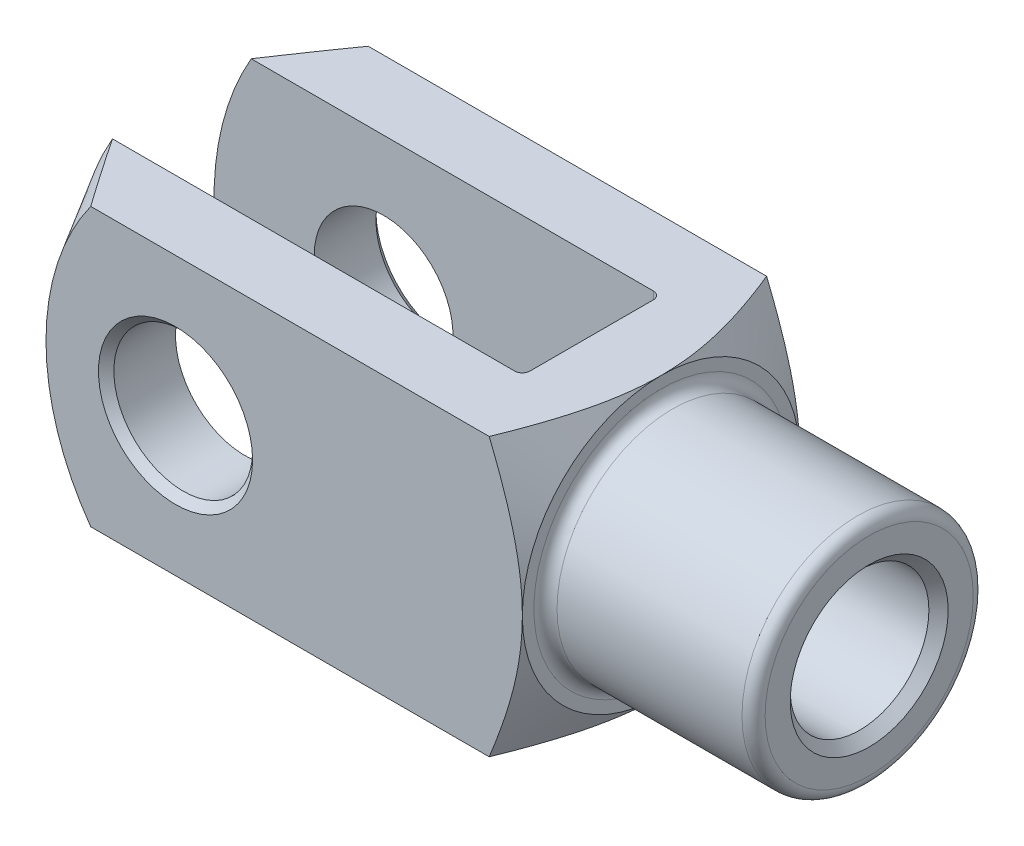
ISO-10303-21;
HEADER;
FILE_DESCRIPTION(('STEP AP214'),'2;1');
FILE_NAME('part.step','',(''),(''),'','','');
FILE_SCHEMA(('AUTOMOTIVE_DESIGN { 1 0 10303 214 1 1 1 1 }'));
ENDSEC;
DATA;
#1=APPLICATION_CONTEXT('core data for automotive mechanical design processes');
#2=APPLICATION_PROTOCOL_DEFINITION('international standard','automotive_design',2000,#1);
#3=PRODUCT_CONTEXT('',#1,'mechanical');
#4=PRODUCT('Part','Part','',(#3));
#5=PRODUCT_RELATED_PRODUCT_CATEGORY('part','',(#4));
#6=PRODUCT_DEFINITION_FORMATION('','',#4);
#7=PRODUCT_DEFINITION_CONTEXT('part definition',#1,'design');
#8=PRODUCT_DEFINITION('design','',#6,#7);
#9=PRODUCT_DEFINITION_SHAPE('','',#8);
#10=(LENGTH_UNIT() NAMED_UNIT(*) SI_UNIT(.MILLI.,.METRE.));
#11=(NAMED_UNIT(*) PLANE_ANGLE_UNIT() SI_UNIT($,.RADIAN.));
#12=(NAMED_UNIT(*) SI_UNIT($,.STERADIAN.) SOLID_ANGLE_UNIT());
#13=UNCERTAINTY_MEASURE_WITH_UNIT(LENGTH_MEASURE(1.E-05),#10,'distance_accuracy_value','');
#14=(GEOMETRIC_REPRESENTATION_CONTEXT(3) GLOBAL_UNCERTAINTY_ASSIGNED_CONTEXT((#13)) GLOBAL_UNIT_ASSIGNED_CONTEXT((#10,
#11,#12)) REPRESENTATION_CONTEXT('',''));
#15=CARTESIAN_POINT('',(0.,0.,0.));
#16=DIRECTION('',(0.,0.,1.));
#17=DIRECTION('',(1.,0.,0.));
#18=AXIS2_PLACEMENT_3D('',#15,#16,#17);
#19=CARTESIAN_POINT('',(-37.,-18.,-7.99999999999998));
#20=DIRECTION('',(0.,-1.,0.));
#21=DIRECTION('',(0.,0.,-1.));
#22=AXIS2_PLACEMENT_3D('',#19,#20,#21);
#23=CYLINDRICAL_SURFACE('',#22,1.);
#24=DIRECTION('',(0.,1.,0.));
#25=VECTOR('',#24,1.);
#26=CARTESIAN_POINT('',(-36.,-18.,-7.99999999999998));
#27=LINE('',#26,#25);
#28=CARTESIAN_POINT('',(-36.,-4.12310562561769,-7.99999999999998));
#29=VERTEX_POINT('',#28);
#30=CARTESIAN_POINT('',(-36.,-18.,-7.99999999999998));
#31=VERTEX_POINT('',#30);
#32=EDGE_CURVE('E359',#29,#31,#27,.F.);
#33=ORIENTED_EDGE('',*,*,#32,.F.);
#34=CARTESIAN_POINT('',(-36.,-4.12310562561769,-7.99999999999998));
#35=CARTESIAN_POINT('',(-36.0000126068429,-4.057953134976,-8.03358080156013));
#36=CARTESIAN_POINT('',(-36.0016908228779,-3.99240500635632,-8.06635429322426));
#37=CARTESIAN_POINT('',(-36.0079935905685,-3.86066972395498,-8.13022612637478));
#38=CARTESIAN_POINT('',(-36.0126168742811,-3.79448285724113,-8.16132518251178));
#39=CARTESIAN_POINT('',(-36.0244135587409,-3.66170122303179,-8.22175508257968));
#40=CARTESIAN_POINT('',(-36.0315817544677,-3.59510755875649,-8.25108939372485));
#41=CARTESIAN_POINT('',(-36.0481648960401,-3.46146330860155,-8.30804124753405));
#42=CARTESIAN_POINT('',(-36.0575801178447,-3.39441266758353,-8.33565857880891));
#43=CARTESIAN_POINT('',(-36.0886937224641,-3.19328216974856,-8.41568207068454));
#44=CARTESIAN_POINT('',(-36.1133182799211,-3.05862477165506,-8.46553184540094));
#45=CARTESIAN_POINT('',(-36.168683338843,-2.78816872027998,-8.55842204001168));
#46=CARTESIAN_POINT('',(-36.1994280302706,-2.65236934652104,-8.60145775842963));
#47=CARTESIAN_POINT('',(-36.2826691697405,-2.31014076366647,-8.70110757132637));
#48=CARTESIAN_POINT('',(-36.338238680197,-2.10317829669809,-8.75337877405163));
#49=CARTESIAN_POINT('',(-36.4566899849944,-1.68816866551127,-8.84280513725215));
#50=CARTESIAN_POINT('',(-36.5195736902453,-1.4801212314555,-8.87995633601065));
#51=CARTESIAN_POINT('',(-36.7151062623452,-0.854721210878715,-8.96921099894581));
#52=CARTESIAN_POINT('',(-36.8546656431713,-0.43600360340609,-8.99914633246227));
#53=CARTESIAN_POINT('',(-36.9960000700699,-0.0119998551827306,-8.99999399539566));
#54=CARTESIAN_POINT('',(-36.9980000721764,-0.00599985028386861,-8.99999999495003));
#55=CARTESIAN_POINT('',(-37.,0.,-8.99999999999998));
#56=B_SPLINE_CURVE_WITH_KNOTS('',3,(#34,#35,#36,#37,#38,#39,#40,#41,#42,#43,#44,#45,#46,#47,#48,
#49,#50,#51,#52,#53,#54,#55),.UNSPECIFIED.,.F.,.F.,(4,2,2,2,2,2,2,2,2,2,4),(0.,
0.219841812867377,0.43958904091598,0.658889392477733,0.878216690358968,1.31489484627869,
1.75187299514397,2.41277681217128,3.07385368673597,4.39566422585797,4.41463790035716),.UNSPECIFIED.);
#57=CARTESIAN_POINT('',(-37.,0.,-8.99999999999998));
#58=VERTEX_POINT('',#57);
#59=EDGE_CURVE('E391',#29,#58,#56,.T.);
#60=ORIENTED_EDGE('',*,*,#59,.T.);
#61=DIRECTION('',(0.,1.,0.));
#62=VECTOR('',#61,1.);
#63=CARTESIAN_POINT('',(-37.,18.,-8.99999999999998));
#64=LINE('',#63,#62);
#65=CARTESIAN_POINT('',(-37.,-18.,-8.99999999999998));
#66=VERTEX_POINT('',#65);
#67=EDGE_CURVE('E183',#66,#58,#64,.T.);
#68=ORIENTED_EDGE('',*,*,#67,.F.);
#69=CARTESIAN_POINT('',(-37.,-18.,-7.99999999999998));
#70=DIRECTION('',(0.,-1.,0.));
#71=DIRECTION('',(0.,0.,-1.));
#72=AXIS2_PLACEMENT_3D('',#69,#70,#71);
#73=CIRCLE('',#72,1.);
#74=EDGE_CURVE('E198',#31,#66,#73,.F.);
#75=ORIENTED_EDGE('',*,*,#74,.F.);
#76=EDGE_LOOP('',(#33,#60,#68,#75));
#77=FACE_BOUND('',#76,.T.);
#78=ADVANCED_FACE('F37',(#77),#23,.F.);
#79=CARTESIAN_POINT('',(-36.,-18.,-8.99999999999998));
#80=DIRECTION('',(1.,0.,0.));
#81=DIRECTION('',(0.,0.,-1.));
#82=AXIS2_PLACEMENT_3D('',#79,#80,#81);
#83=PLANE('',#82);
#84=CARTESIAN_POINT('',(-36.,18.,-7.99999999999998));
#85=VERTEX_POINT('',#84);
#86=CARTESIAN_POINT('',(-36.,4.12310562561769,-7.99999999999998));
#87=VERTEX_POINT('',#86);
#88=EDGE_CURVE('E375',#85,#87,#27,.F.);
#89=ORIENTED_EDGE('',*,*,#88,.T.);
#90=CARTESIAN_POINT('',(-36.,0.,0.));
#91=DIRECTION('',(1.,0.,0.));
#92=DIRECTION('',(0.,0.,-1.));
#93=AXIS2_PLACEMENT_3D('',#90,#91,#92);
#94=CIRCLE('',#93,9.);
#95=CARTESIAN_POINT('',(-36.,4.12310562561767,7.99999999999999));
#96=VERTEX_POINT('',#95);
#97=EDGE_CURVE('E419',#87,#96,#94,.T.);
#98=ORIENTED_EDGE('',*,*,#97,.T.);
#99=DIRECTION('',(0.,1.,0.));
#100=VECTOR('',#99,1.);
#101=CARTESIAN_POINT('',(-36.,18.,7.99999999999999));
#102=LINE('',#101,#100);
#103=CARTESIAN_POINT('',(-36.,18.,7.99999999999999));
#104=VERTEX_POINT('',#103);
#105=EDGE_CURVE('E160',#96,#104,#102,.T.);
#106=ORIENTED_EDGE('',*,*,#105,.T.);
#107=DIRECTION('',(0.,0.,-1.));
#108=VECTOR('',#107,1.);
#109=CARTESIAN_POINT('',(-36.,18.,-8.99999999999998));
#110=LINE('',#109,#108);
#111=EDGE_CURVE('E339',#104,#85,#110,.T.);
#112=ORIENTED_EDGE('',*,*,#111,.T.);
#113=EDGE_LOOP('',(#89,#98,#106,#112));
#114=FACE_BOUND('',#113,.T.);
#115=ADVANCED_FACE('F447',(#114),#83,.F.);
#116=CARTESIAN_POINT('',(-37.,-18.,7.99999999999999));
#117=DIRECTION('',(0.,-1.,0.));
#118=DIRECTION('',(0.,0.,-1.));
#119=AXIS2_PLACEMENT_3D('',#116,#117,#118);
#120=CYLINDRICAL_SURFACE('',#119,1.);
#121=ORIENTED_EDGE('',*,*,#105,.F.);
#122=CARTESIAN_POINT('',(-36.,4.12310562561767,7.99999999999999));
#123=CARTESIAN_POINT('',(-36.0000126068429,4.05795313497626,8.03358080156));
#124=CARTESIAN_POINT('',(-36.0016908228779,3.99240500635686,8.06635429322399));
#125=CARTESIAN_POINT('',(-36.0079935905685,3.86066972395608,8.13022612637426));
#126=CARTESIAN_POINT('',(-36.012616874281,3.79448285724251,8.16132518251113));
#127=CARTESIAN_POINT('',(-36.0244135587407,3.66170122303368,8.22175508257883));
#128=CARTESIAN_POINT('',(-36.0315817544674,3.59510755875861,8.25108939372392));
#129=CARTESIAN_POINT('',(-36.0481648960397,3.46146330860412,8.30804124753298));
#130=CARTESIAN_POINT('',(-36.0575801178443,3.39441266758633,8.33565857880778));
#131=CARTESIAN_POINT('',(-36.0886937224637,3.19328216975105,8.4156820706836));
#132=CARTESIAN_POINT('',(-36.1133182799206,3.058624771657,8.46553184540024));
#133=CARTESIAN_POINT('',(-36.1686833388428,2.78816872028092,8.55842204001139));
#134=CARTESIAN_POINT('',(-36.1994280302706,2.65236934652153,8.60145775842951));
#135=CARTESIAN_POINT('',(-36.2826691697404,2.31014076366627,8.7011075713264));
#136=CARTESIAN_POINT('',(-36.338238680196,2.10317829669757,8.75337877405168));
#137=CARTESIAN_POINT('',(-36.4566899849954,1.6881686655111,8.84280513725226));
#138=CARTESIAN_POINT('',(-36.5195736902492,1.48012123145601,8.8799563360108));
#139=CARTESIAN_POINT('',(-36.715106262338,0.854721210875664,8.96921099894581));
#140=CARTESIAN_POINT('',(-36.8546656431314,0.43600360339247,8.99914633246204));
#141=CARTESIAN_POINT('',(-36.9960000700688,0.011999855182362,8.99999399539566));
#142=CARTESIAN_POINT('',(-36.9980000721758,0.00599985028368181,8.99999999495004));
#143=CARTESIAN_POINT('',(-37.,0.,8.99999999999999));
#144=B_SPLINE_CURVE_WITH_KNOTS('',3,(#122,#123,#124,#125,#126,#127,#128,#129,#130,#131,#132,
#133,#134,#135,#136,#137,#138,#139,#140,#141,#142,#143),.UNSPECIFIED.,.F.,.F.,(4,2,2,2,2,2,2,2,
2,2,4),(0.,0.219841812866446,0.439589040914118,0.658889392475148,0.878216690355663,
1.31489484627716,1.751872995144,2.41277681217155,3.07385368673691,4.39566422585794,
4.41463790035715),.UNSPECIFIED.);
#145=CARTESIAN_POINT('',(-37.,0.,8.99999999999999));
#146=VERTEX_POINT('',#145);
#147=EDGE_CURVE('E145',#96,#146,#144,.T.);
#148=ORIENTED_EDGE('',*,*,#147,.T.);
#149=DIRECTION('',(0.,1.,0.));
#150=VECTOR('',#149,1.);
#151=CARTESIAN_POINT('',(-37.,-18.,8.99999999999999));
#152=LINE('',#151,#150);
#153=CARTESIAN_POINT('',(-37.,18.,8.99999999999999));
#154=VERTEX_POINT('',#153);
#155=EDGE_CURVE('E159',#154,#146,#152,.F.);
#156=ORIENTED_EDGE('',*,*,#155,.F.);
#157=CARTESIAN_POINT('',(-37.,18.,7.99999999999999));
#158=DIRECTION('',(0.,1.,0.));
#159=DIRECTION('',(0.,0.,1.));
#160=AXIS2_PLACEMENT_3D('',#157,#158,#159);
#161=CIRCLE('',#160,1.);
#162=EDGE_CURVE('E190',#104,#154,#161,.F.);
#163=ORIENTED_EDGE('',*,*,#162,.F.);
#164=EDGE_LOOP('',(#121,#148,#156,#163));
#165=FACE_BOUND('',#164,.T.);
#166=ADVANCED_FACE('F156',(#165),#120,.F.);
#167=CARTESIAN_POINT('',(-94.,-18.,-8.99999999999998));
#168=DIRECTION('',(0.,0.,-1.));
#169=DIRECTION('',(-1.,0.,0.));
#170=AXIS2_PLACEMENT_3D('',#167,#168,#169);
#171=PLANE('',#170);
#172=CARTESIAN_POINT('',(-72.,0.,-8.99999999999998));
#173=DIRECTION('',(0.,0.,-1.));
#174=DIRECTION('',(-1.,0.,0.));
#175=AXIS2_PLACEMENT_3D('',#172,#173,#174);
#176=CIRCLE('',#175,9.);
#177=CARTESIAN_POINT('',(-81.,0.,-8.99999999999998));
#178=VERTEX_POINT('',#177);
#179=EDGE_CURVE('E369',#178,#178,#176,.F.);
#180=ORIENTED_EDGE('',*,*,#179,.F.);
#181=EDGE_LOOP('',(#180));
#182=FACE_BOUND('',#181,.T.);
#183=CARTESIAN_POINT('',(-58.,0.,-8.99999999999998));
#184=DIRECTION('',(0.,0.,1.));
#185=DIRECTION('',(1.,0.,0.));
#186=AXIS2_PLACEMENT_3D('',#183,#184,#185);
#187=CIRCLE('',#186,36.);
#188=CARTESIAN_POINT('',(-89.1769145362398,18.,-8.99999999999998));
#189=VERTEX_POINT('',#188);
#190=CARTESIAN_POINT('',(-89.1769145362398,-18.,-8.99999999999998));
#191=VERTEX_POINT('',#190);
#192=EDGE_CURVE('E277',#189,#191,#187,.T.);
#193=ORIENTED_EDGE('',*,*,#192,.T.);
#194=DIRECTION('',(-1.,0.,0.));
#195=VECTOR('',#194,1.);
#196=CARTESIAN_POINT('',(-94.,-18.,-8.99999999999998));
#197=LINE('',#196,#195);
#198=EDGE_CURVE('E334',#66,#191,#197,.T.);
#199=ORIENTED_EDGE('',*,*,#198,.F.);
#200=ORIENTED_EDGE('',*,*,#67,.T.);
#201=CARTESIAN_POINT('',(-37.,18.,-8.99999999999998));
#202=VERTEX_POINT('',#201);
#203=EDGE_CURVE('E179',#58,#202,#64,.T.);
#204=ORIENTED_EDGE('',*,*,#203,.T.);
#205=DIRECTION('',(-1.,0.,0.));
#206=VECTOR('',#205,1.);
#207=CARTESIAN_POINT('',(-94.,18.,-8.99999999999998));
#208=LINE('',#207,#206);
#209=EDGE_CURVE('E347',#202,#189,#208,.T.);
#210=ORIENTED_EDGE('',*,*,#209,.T.);
#211=EDGE_LOOP('',(#193,#199,#200,#204,#210));
#212=FACE_BOUND('',#211,.T.);
#213=ADVANCED_FACE('F394',(#182,#212),#171,.F.);
#214=CARTESIAN_POINT('',(-94.,-18.,9.00000000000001));
#215=DIRECTION('',(0.,0.,1.));
#216=DIRECTION('',(1.,0.,0.));
#217=AXIS2_PLACEMENT_3D('',#214,#215,#216);
#218=PLANE('',#217);
#219=CARTESIAN_POINT('',(-72.,0.,9.));
#220=DIRECTION('',(0.,0.,1.));
#221=DIRECTION('',(1.,0.,0.));
#222=AXIS2_PLACEMENT_3D('',#219,#220,#221);
#223=CIRCLE('',#222,9.);
#224=CARTESIAN_POINT('',(-63.,0.,9.));
#225=VERTEX_POINT('',#224);
#226=EDGE_CURVE('E346',#225,#225,#223,.F.);
#227=ORIENTED_EDGE('',*,*,#226,.F.);
#228=EDGE_LOOP('',(#227));
#229=FACE_BOUND('',#228,.T.);
#230=DIRECTION('',(1.,0.,0.));
#231=VECTOR('',#230,1.);
#232=CARTESIAN_POINT('',(-94.,-18.,9.00000000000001));
#233=LINE('',#232,#231);
#234=CARTESIAN_POINT('',(-89.1769145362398,-18.,9.00000000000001));
#235=VERTEX_POINT('',#234);
#236=CARTESIAN_POINT('',(-37.,-18.,8.99999999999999));
#237=VERTEX_POINT('',#236);
#238=EDGE_CURVE('E338',#235,#237,#233,.T.);
#239=ORIENTED_EDGE('',*,*,#238,.F.);
#240=CARTESIAN_POINT('',(-58.,0.,9.00000000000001));
#241=DIRECTION('',(0.,0.,1.));
#242=DIRECTION('',(1.,0.,0.));
#243=AXIS2_PLACEMENT_3D('',#240,#241,#242);
#244=CIRCLE('',#243,36.);
#245=CARTESIAN_POINT('',(-89.1769145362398,18.,9.00000000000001));
#246=VERTEX_POINT('',#245);
#247=EDGE_CURVE('E423',#246,#235,#244,.T.);
#248=ORIENTED_EDGE('',*,*,#247,.F.);
#249=DIRECTION('',(1.,0.,0.));
#250=VECTOR('',#249,1.);
#251=CARTESIAN_POINT('',(-94.,18.,9.00000000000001));
#252=LINE('',#251,#250);
#253=EDGE_CURVE('E176',#246,#154,#252,.T.);
#254=ORIENTED_EDGE('',*,*,#253,.T.);
#255=ORIENTED_EDGE('',*,*,#155,.T.);
#256=EDGE_CURVE('E164',#146,#237,#152,.F.);
#257=ORIENTED_EDGE('',*,*,#256,.T.);
#258=EDGE_LOOP('',(#239,#248,#254,#255,#257));
#259=FACE_BOUND('',#258,.T.);
#260=ADVANCED_FACE('F173',(#229,#259),#218,.F.);
#261=CARTESIAN_POINT('',(-94.,-18.,18.));
#262=DIRECTION('',(0.,0.,1.));
#263=DIRECTION('',(1.,0.,0.));
#264=AXIS2_PLACEMENT_3D('',#261,#262,#263);
#265=PLANE('',#264);
#266=CARTESIAN_POINT('',(-72.,0.,18.));
#267=DIRECTION('',(0.,0.,1.));
#268=DIRECTION('',(1.,0.,0.));
#269=AXIS2_PLACEMENT_3D('',#266,#267,#268);
#270=CIRCLE('',#269,10.);
#271=CARTESIAN_POINT('',(-62.,0.,18.));
#272=VERTEX_POINT('',#271);
#273=EDGE_CURVE('E229',#272,#272,#270,.F.);
#274=ORIENTED_EDGE('',*,*,#273,.T.);
#275=EDGE_LOOP('',(#274));
#276=FACE_BOUND('',#275,.T.);
#277=DIRECTION('',(1.,0.,0.));
#278=VECTOR('',#277,1.);
#279=CARTESIAN_POINT('',(-94.,18.,18.));
#280=LINE('',#279,#278);
#281=CARTESIAN_POINT('',(-82.9975403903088,18.,18.));
#282=VERTEX_POINT('',#281);
#283=CARTESIAN_POINT('',(-31.3046336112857,18.,18.));
#284=VERTEX_POINT('',#283);
#285=EDGE_CURVE('E366',#282,#284,#280,.T.);
#286=ORIENTED_EDGE('',*,*,#285,.F.);
#287=CARTESIAN_POINT('',(-58.,0.,18.));
#288=DIRECTION('',(0.,0.,1.));
#289=DIRECTION('',(1.,0.,0.));
#290=AXIS2_PLACEMENT_3D('',#287,#288,#289);
#291=CIRCLE('',#290,30.8038475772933);
#292=CARTESIAN_POINT('',(-82.9975403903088,-18.,18.));
#293=VERTEX_POINT('',#292);
#294=EDGE_CURVE('E61',#282,#293,#291,.T.);
#295=ORIENTED_EDGE('',*,*,#294,.T.);
#296=DIRECTION('',(1.,0.,0.));
#297=VECTOR('',#296,1.);
#298=CARTESIAN_POINT('',(-94.,-18.,18.));
#299=LINE('',#298,#297);
#300=CARTESIAN_POINT('',(-31.3046336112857,-18.,18.));
#301=VERTEX_POINT('',#300);
#302=EDGE_CURVE('E363',#293,#301,#299,.T.);
#303=ORIENTED_EDGE('',*,*,#302,.T.);
#304=CARTESIAN_POINT('',(-40.2405722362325,-36.7632783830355,18.));
#305=CARTESIAN_POINT('',(-40.0105725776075,-36.3197153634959,18.));
#306=CARTESIAN_POINT('',(-39.7812032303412,-35.8758256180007,18.));
#307=CARTESIAN_POINT('',(-39.3238600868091,-34.9873260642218,18.));
#308=CARTESIAN_POINT('',(-39.0958862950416,-34.5427162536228,18.));
#309=CARTESIAN_POINT('',(-38.4142399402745,-33.2076661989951,18.));
#310=CARTESIAN_POINT('',(-37.9628656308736,-32.3160500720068,18.));
#311=CARTESIAN_POINT('',(-37.0668423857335,-30.5274977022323,18.));
#312=CARTESIAN_POINT('',(-36.6222065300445,-29.6305548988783,18.));
#313=CARTESIAN_POINT('',(-35.742288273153,-27.8321038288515,18.));
#314=CARTESIAN_POINT('',(-35.3070057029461,-26.9305956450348,18.));
#315=CARTESIAN_POINT('',(-34.4217688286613,-25.0663534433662,18.));
#316=CARTESIAN_POINT('',(-33.9725594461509,-24.103264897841,18.));
#317=CARTESIAN_POINT('',(-33.0912213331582,-22.1691957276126,18.));
#318=CARTESIAN_POINT('',(-32.6590934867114,-21.19821469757,18.));
#319=CARTESIAN_POINT('',(-32.0279376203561,-19.7346450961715,18.));
#320=CARTESIAN_POINT('',(-31.8204335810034,-19.2457093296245,18.));
#321=CARTESIAN_POINT('',(-31.4119626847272,-18.2651149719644,18.));
#322=CARTESIAN_POINT('',(-31.2109957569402,-17.7734564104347,18.));
#323=CARTESIAN_POINT('',(-30.8166365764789,-16.7871551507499,18.));
#324=CARTESIAN_POINT('',(-30.623243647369,-16.292512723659,18.));
#325=CARTESIAN_POINT('',(-30.2452342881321,-15.2998877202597,18.));
#326=CARTESIAN_POINT('',(-30.0606177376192,-14.8019051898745,18.));
#327=CARTESIAN_POINT('',(-29.6626454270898,-13.6938703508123,18.));
#328=CARTESIAN_POINT('',(-29.4517390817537,-13.0829330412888,18.));
#329=CARTESIAN_POINT('',(-29.0480757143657,-11.855117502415,18.));
#330=CARTESIAN_POINT('',(-28.8553171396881,-11.2382397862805,18.));
#331=CARTESIAN_POINT('',(-28.4915272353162,-9.99807877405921,18.));
#332=CARTESIAN_POINT('',(-28.3204954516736,-9.37479561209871,18.));
#333=CARTESIAN_POINT('',(-28.0042438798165,-8.1216622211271,18.));
#334=CARTESIAN_POINT('',(-27.8590238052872,-7.49181206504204,18.));
#335=CARTESIAN_POINT('',(-27.6018286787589,-6.24070277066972,18.));
#336=CARTESIAN_POINT('',(-27.4891532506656,-5.61958903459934,18.));
#337=CARTESIAN_POINT('',(-27.2965642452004,-4.37225988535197,18.));
#338=CARTESIAN_POINT('',(-27.2166496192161,-3.74604463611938,18.));
#339=CARTESIAN_POINT('',(-27.0929227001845,-2.49042427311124,18.));
#340=CARTESIAN_POINT('',(-27.0490868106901,-1.86102151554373,18.));
#341=CARTESIAN_POINT('',(-26.9994512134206,-0.600711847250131,18.));
#342=CARTESIAN_POINT('',(-26.9936501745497,0.030195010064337,18.));
#343=CARTESIAN_POINT('',(-27.0193731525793,1.24522213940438,18.));
#344=CARTESIAN_POINT('',(-27.0482082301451,1.82940177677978,18.));
#345=CARTESIAN_POINT('',(-27.1376196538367,2.99530093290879,18.));
#346=CARTESIAN_POINT('',(-27.1981959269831,3.57702045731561,18.));
#347=CARTESIAN_POINT('',(-27.34886904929,4.73688551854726,18.));
#348=CARTESIAN_POINT('',(-27.438981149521,5.31502905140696,18.));
#349=CARTESIAN_POINT('',(-27.6457548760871,6.46651779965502,18.));
#350=CARTESIAN_POINT('',(-27.7624172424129,7.03986288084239,18.));
#351=CARTESIAN_POINT('',(-28.0227602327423,8.19779167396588,18.));
#352=CARTESIAN_POINT('',(-28.1671251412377,8.78222035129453,18.));
#353=CARTESIAN_POINT('',(-28.4770472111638,9.94539252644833,18.));
#354=CARTESIAN_POINT('',(-28.6426045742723,10.5241359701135,18.));
#355=CARTESIAN_POINT('',(-28.9917080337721,11.6761185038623,18.));
#356=CARTESIAN_POINT('',(-29.1752533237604,12.2493578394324,18.));
#357=CARTESIAN_POINT('',(-29.4619599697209,13.1053541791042,18.));
#358=CARTESIAN_POINT('',(-29.5594253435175,13.3900380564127,18.));
#359=CARTESIAN_POINT('',(-29.7578505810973,13.9581848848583,18.));
#360=CARTESIAN_POINT('',(-29.8588104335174,14.2416478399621,18.));
#361=CARTESIAN_POINT('',(-30.1832067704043,15.1363970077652,18.));
#362=CARTESIAN_POINT('',(-30.412533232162,15.7455526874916,18.));
#363=CARTESIAN_POINT('',(-30.8836375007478,16.9590446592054,18.));
#364=CARTESIAN_POINT('',(-31.1254160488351,17.5633806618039,18.));
#365=CARTESIAN_POINT('',(-31.6194138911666,18.7679201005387,18.));
#366=CARTESIAN_POINT('',(-31.8716355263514,19.3681225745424,18.));
#367=CARTESIAN_POINT('',(-32.3847822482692,20.5647731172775,18.));
#368=CARTESIAN_POINT('',(-32.6457071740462,21.1612212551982,18.));
#369=CARTESIAN_POINT('',(-33.1751260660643,22.3513599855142,18.));
#370=CARTESIAN_POINT('',(-33.443626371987,22.9450477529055,18.));
#371=CARTESIAN_POINT('',(-33.9868624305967,24.1295621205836,18.));
#372=CARTESIAN_POINT('',(-34.2615982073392,24.7203887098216,18.));
#373=CARTESIAN_POINT('',(-34.8163538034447,25.8994690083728,18.));
#374=CARTESIAN_POINT('',(-35.0963730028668,26.4877230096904,18.));
#375=CARTESIAN_POINT('',(-35.6609782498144,27.6620368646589,18.));
#376=CARTESIAN_POINT('',(-35.9455643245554,28.2480967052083,18.));
#377=CARTESIAN_POINT('',(-36.8069484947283,30.006950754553,18.));
#378=CARTESIAN_POINT('',(-37.3896789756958,31.1768405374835,18.));
#379=CARTESIAN_POINT('',(-38.5670559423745,33.5106205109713,18.));
#380=CARTESIAN_POINT('',(-39.1617026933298,34.6745105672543,18.));
#381=CARTESIAN_POINT('',(-40.3599132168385,36.9969592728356,18.));
#382=CARTESIAN_POINT('',(-40.9634724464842,38.1555202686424,18.));
#383=CARTESIAN_POINT('',(-42.1778240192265,40.4688291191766,18.));
#384=CARTESIAN_POINT('',(-42.7886163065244,41.6235770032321,18.));
#385=CARTESIAN_POINT('',(-43.9248536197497,43.7587282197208,18.));
#386=CARTESIAN_POINT('',(-44.4495025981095,44.7395555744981,18.));
#387=CARTESIAN_POINT('',(-45.5023194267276,46.6993204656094,18.));
#388=CARTESIAN_POINT('',(-46.0304872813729,47.6782579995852,18.));
#389=CARTESIAN_POINT('',(-47.6195621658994,50.6129487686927,18.));
#390=CARTESIAN_POINT('',(-48.6848943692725,52.5663063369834,18.));
#391=CARTESIAN_POINT('',(-50.2862726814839,55.4872150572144,18.));
#392=CARTESIAN_POINT('',(-50.819085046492,56.4565433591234,18.));
#393=CARTESIAN_POINT('',(-51.8865645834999,58.3941789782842,18.));
#394=CARTESIAN_POINT('',(-52.4212317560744,59.3624862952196,18.));
#395=CARTESIAN_POINT('',(-53.4920885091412,61.2980584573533,18.));
#396=CARTESIAN_POINT('',(-54.0282778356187,62.2653234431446,18.));
#397=CARTESIAN_POINT('',(-55.1020695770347,64.1990673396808,18.));
#398=CARTESIAN_POINT('',(-55.6396719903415,65.1655462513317,18.));
#399=CARTESIAN_POINT('',(-56.1778848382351,66.1316848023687,18.));
#400=B_SPLINE_CURVE_WITH_KNOTS('',3,(#304,#305,#306,#307,#308,#309,#310,#311,#312,#313,#314,
#315,#316,#317,#318,#319,#320,#321,#322,#323,#324,#325,#326,#327,#328,#329,#330,#331,#332,#333,
#334,#335,#336,#337,#338,#339,#340,#341,#342,#343,#344,#345,#346,#347,#348,#349,#350,#351,#352,
#353,#354,#355,#356,#357,#358,#359,#360,#361,#362,#363,#364,#365,#366,#367,#368,#369,#370,#371,
#372,#373,#374,#375,#376,#377,#378,#379,#380,#381,#382,#383,#384,#385,#386,#387,#388,#389,#390,
#391,#392,#393,#394,#395,#396,#397,#398,#399),.UNSPECIFIED.,.F.,.F.,(4,2,2,2,2,2,2,2,2,2,2,2,2,
2,2,2,2,2,2,2,2,2,2,2,2,2,2,2,2,2,2,2,2,2,2,2,2,2,2,2,2,2,2,2,2,2,2,4),(0.,1.49894265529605,
2.99789013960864,5.99593634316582,8.99920323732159,12.0024158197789,15.1903943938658,
18.37853774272,19.9719380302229,21.5653210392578,23.1585614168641,24.7517799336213,
26.6904915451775,28.6290371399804,30.5675422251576,32.5060258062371,34.3990052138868,
36.2919240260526,38.1836038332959,40.0752174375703,41.8289960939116,43.5827707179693,
45.3374523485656,47.0921828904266,48.8977025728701,50.7032394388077,52.5086953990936,
53.411394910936,54.3140914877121,56.2665854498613,58.2191957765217,60.1722461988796,
62.1252605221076,64.0799608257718,66.0346686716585,67.9891485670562,69.9436401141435,
73.864500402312,77.7854480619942,81.7044617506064,85.6234452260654,88.9604281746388,
92.2974152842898,98.9723206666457,102.290659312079,105.608998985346,108.926814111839,
112.244625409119),.UNSPECIFIED.);
#401=CARTESIAN_POINT('',(-27.,0.,18.));
#402=VERTEX_POINT('',#401);
#403=EDGE_CURVE('E306',#402,#301,#400,.F.);
#404=ORIENTED_EDGE('',*,*,#403,.F.);
#405=EDGE_CURVE('E304',#284,#402,#400,.F.);
#406=ORIENTED_EDGE('',*,*,#405,.F.);
#407=EDGE_LOOP('',(#286,#295,#303,#404,#406));
#408=FACE_BOUND('',#407,.T.);
#409=ADVANCED_FACE('F288',(#276,#408),#265,.T.);
#410=CARTESIAN_POINT('',(-94.,-18.,18.));
#411=DIRECTION('',(0.,-1.,0.));
#412=DIRECTION('',(0.,0.,-1.));
#413=AXIS2_PLACEMENT_3D('',#410,#411,#412);
#414=PLANE('',#413);
#415=ORIENTED_EDGE('',*,*,#198,.T.);
#416=CARTESIAN_POINT('',(-103.41784238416,-18.,13.2649703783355));
#417=CARTESIAN_POINT('',(-102.979965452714,-18.,12.5599029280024));
#418=CARTESIAN_POINT('',(-102.541471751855,-18.,11.8552185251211));
#419=CARTESIAN_POINT('',(-101.663133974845,-18.,10.4466909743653));
#420=CARTESIAN_POINT('',(-101.223289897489,-18.,9.74284782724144));
#421=CARTESIAN_POINT('',(-99.9015410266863,-18.,7.63266776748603));
#422=CARTESIAN_POINT('',(-99.0174364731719,-18.,6.22770743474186));
#423=CARTESIAN_POINT('',(-97.2411537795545,-18.,3.4205464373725));
#424=CARTESIAN_POINT('',(-96.3489672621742,-18.,2.01835106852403));
#425=CARTESIAN_POINT('',(-95.0042911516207,-18.,-0.0808333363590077));
#426=CARTESIAN_POINT('',(-94.5550021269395,-18.,-0.779872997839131));
#427=CARTESIAN_POINT('',(-93.6540505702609,-18.,-2.17642782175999));
#428=CARTESIAN_POINT('',(-93.2023880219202,-18.,-2.87394297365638));
#429=CARTESIAN_POINT('',(-91.8057543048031,-18.,-5.02193188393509));
#430=CARTESIAN_POINT('',(-90.8564015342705,-18.,-6.46956195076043));
#431=CARTESIAN_POINT('',(-88.9433785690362,-18.,-9.35533210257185));
#432=CARTESIAN_POINT('',(-87.9797085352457,-18.,-10.7934722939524));
#433=CARTESIAN_POINT('',(-86.5206774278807,-18.,-12.9407207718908));
#434=CARTESIAN_POINT('',(-86.0322614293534,-18.,-13.654549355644));
#435=CARTESIAN_POINT('',(-85.0501071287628,-18.,-15.0785415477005));
#436=CARTESIAN_POINT('',(-84.5563688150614,-18.,-15.7887051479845));
#437=CARTESIAN_POINT('',(-83.5627811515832,-18.,-17.2046996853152));
#438=CARTESIAN_POINT('',(-83.0629320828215,-18.,-17.9105308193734));
#439=CARTESIAN_POINT('',(-82.0561048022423,-18.,-19.3170848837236));
#440=CARTESIAN_POINT('',(-81.5491266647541,-18.,-20.017807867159));
#441=CARTESIAN_POINT('',(-80.5315660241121,-18.,-21.4066300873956));
#442=CARTESIAN_POINT('',(-80.0210611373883,-18.,-22.0947861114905));
#443=CARTESIAN_POINT('',(-78.9903313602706,-18.,-23.4638130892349));
#444=CARTESIAN_POINT('',(-78.4701062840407,-18.,-24.1446839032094));
#445=CARTESIAN_POINT('',(-77.4173327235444,-18.,-25.4983549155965));
#446=CARTESIAN_POINT('',(-76.8847682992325,-18.,-26.171142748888));
#447=CARTESIAN_POINT('',(-75.8056076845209,-18.,-27.5053350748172));
#448=CARTESIAN_POINT('',(-75.2590122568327,-18.,-28.1667401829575));
#449=CARTESIAN_POINT('',(-74.1543598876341,-18.,-29.4682414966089));
#450=CARTESIAN_POINT('',(-73.59648061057,-18.,-30.1084875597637));
#451=CARTESIAN_POINT('',(-72.7439263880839,-18.,-31.0548465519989));
#452=CARTESIAN_POINT('',(-72.4570726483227,-18.,-31.3680127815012));
#453=CARTESIAN_POINT('',(-71.8775081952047,-18.,-31.9888708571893));
#454=CARTESIAN_POINT('',(-71.5847976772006,-18.,-32.2965628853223));
#455=CARTESIAN_POINT('',(-70.9934617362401,-18.,-32.9048915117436));
#456=CARTESIAN_POINT('',(-70.6948509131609,-18.,-33.2055422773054));
#457=CARTESIAN_POINT('',(-70.0902529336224,-18.,-33.7993806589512));
#458=CARTESIAN_POINT('',(-69.7842654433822,-18.,-34.0925679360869));
#459=CARTESIAN_POINT('',(-69.1641708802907,-18.,-34.6698930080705));
#460=CARTESIAN_POINT('',(-68.8500684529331,-18.,-34.9540357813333));
#461=CARTESIAN_POINT('',(-68.2125594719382,-18.,-35.5116478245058));
#462=CARTESIAN_POINT('',(-67.8891542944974,-18.,-35.785118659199));
#463=CARTESIAN_POINT('',(-67.3903285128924,-18.,-36.1903940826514));
#464=CARTESIAN_POINT('',(-67.21874231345,-18.,-36.3269269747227));
#465=CARTESIAN_POINT('',(-66.8725822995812,-18.,-36.5961477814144));
#466=CARTESIAN_POINT('',(-66.6980084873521,-18.,-36.7288356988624));
#467=CARTESIAN_POINT('',(-66.1694658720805,-18.,-37.120572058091));
#468=CARTESIAN_POINT('',(-65.810721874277,-18.,-37.3732554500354));
#469=CARTESIAN_POINT('',(-65.0794835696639,-18.,-37.8573350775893));
#470=CARTESIAN_POINT('',(-64.7070003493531,-18.,-38.088747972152));
#471=CARTESIAN_POINT('',(-63.9468949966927,-18.,-38.5253159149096));
#472=CARTESIAN_POINT('',(-63.5592768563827,-18.,-38.7304778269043));
#473=CARTESIAN_POINT('',(-62.8586737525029,-18.,-39.0650981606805));
#474=CARTESIAN_POINT('',(-62.548845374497,-18.,-39.2011478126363));
#475=CARTESIAN_POINT('',(-61.9201168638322,-18.,-39.4505194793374));
#476=CARTESIAN_POINT('',(-61.6012175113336,-18.,-39.563843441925));
#477=CARTESIAN_POINT('',(-60.9556690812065,-18.,-39.7641785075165));
#478=CARTESIAN_POINT('',(-60.629031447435,-18.,-39.8512261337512));
#479=CARTESIAN_POINT('',(-59.9692664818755,-18.,-39.9960070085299));
#480=CARTESIAN_POINT('',(-59.6361394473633,-18.,-40.0537415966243));
#481=CARTESIAN_POINT('',(-58.9625132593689,-18.,-40.1378469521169));
#482=CARTESIAN_POINT('',(-58.621973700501,-18.,-40.1638984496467));
#483=CARTESIAN_POINT('',(-57.9399876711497,-18.,-40.1823341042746));
#484=CARTESIAN_POINT('',(-57.5985412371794,-18.,-40.1747195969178));
#485=CARTESIAN_POINT('',(-56.9179820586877,-18.,-40.1261912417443));
#486=CARTESIAN_POINT('',(-56.5788697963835,-18.,-40.0852707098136));
#487=CARTESIAN_POINT('',(-55.9059547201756,-18.,-39.9720133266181));
#488=CARTESIAN_POINT('',(-55.5721527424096,-18.,-39.8996715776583));
#489=CARTESIAN_POINT('',(-54.8509499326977,-18.,-39.7104873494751));
#490=CARTESIAN_POINT('',(-54.4650678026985,-18.,-39.5878855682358));
#491=CARTESIAN_POINT('',(-53.7058176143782,-18.,-39.30844830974));
#492=CARTESIAN_POINT('',(-53.332456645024,-18.,-39.1515938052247));
#493=CARTESIAN_POINT('',(-52.7819431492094,-18.,-38.8947743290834));
#494=CARTESIAN_POINT('',(-52.5997347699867,-18.,-38.805413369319));
#495=CARTESIAN_POINT('',(-52.2387189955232,-18.,-38.6202385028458));
#496=CARTESIAN_POINT('',(-52.0599101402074,-18.,-38.5244274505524));
#497=CARTESIAN_POINT('',(-51.7055718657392,-18.,-38.3269455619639));
#498=CARTESIAN_POINT('',(-51.5300423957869,-18.,-38.2252748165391));
#499=CARTESIAN_POINT('',(-51.1821454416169,-18.,-38.0166187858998));
#500=CARTESIAN_POINT('',(-51.0097784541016,-18.,-37.9096326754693));
#501=CARTESIAN_POINT('',(-50.3852837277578,-18.,-37.5098055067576));
#502=CARTESIAN_POINT('',(-49.9423760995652,-18.,-37.2024738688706));
#503=CARTESIAN_POINT('',(-49.0756132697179,-18.,-36.5619753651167));
#504=CARTESIAN_POINT('',(-48.651767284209,-18.,-36.228796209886));
#505=CARTESIAN_POINT('',(-47.8198735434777,-18.,-35.5417740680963));
#506=CARTESIAN_POINT('',(-47.4118578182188,-18.,-35.1878924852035));
#507=CARTESIAN_POINT('',(-46.6102252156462,-18.,-34.464399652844));
#508=CARTESIAN_POINT('',(-46.2166059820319,-18.,-34.094790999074));
#509=CARTESIAN_POINT('',(-45.4390660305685,-18.,-33.3404359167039));
#510=CARTESIAN_POINT('',(-45.0552278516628,-18.,-32.9556047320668));
#511=CARTESIAN_POINT('',(-44.2982514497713,-18.,-32.1755673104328));
#512=CARTESIAN_POINT('',(-43.925113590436,-18.,-31.7803607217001));
#513=CARTESIAN_POINT('',(-43.1884717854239,-18.,-30.9818482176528));
#514=CARTESIAN_POINT('',(-42.8249582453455,-18.,-30.5785511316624));
#515=CARTESIAN_POINT('',(-42.1059592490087,-18.,-29.7648935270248));
#516=CARTESIAN_POINT('',(-41.7504736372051,-18.,-29.3545331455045));
#517=CARTESIAN_POINT('',(-40.9006293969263,-18.,-28.3565840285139));
#518=CARTESIAN_POINT('',(-40.4097663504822,-18.,-27.7660198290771));
#519=CARTESIAN_POINT('',(-39.4395922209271,-18.,-26.5753176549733));
#520=CARTESIAN_POINT('',(-38.9602834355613,-18.,-25.975177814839));
#521=CARTESIAN_POINT('',(-38.0187402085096,-18.,-24.7764597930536));
#522=CARTESIAN_POINT('',(-37.5563566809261,-18.,-24.1779985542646));
#523=CARTESIAN_POINT('',(-36.8689319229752,-18.,-23.2757755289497));
#524=CARTESIAN_POINT('',(-36.6408485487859,-18.,-22.9743240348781));
#525=CARTESIAN_POINT('',(-36.1865643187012,-18.,-22.3700102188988));
#526=CARTESIAN_POINT('',(-35.9603634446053,-18.,-22.0671479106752));
#527=CARTESIAN_POINT('',(-35.7350296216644,-18.,-21.7636413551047));
#528=B_SPLINE_CURVE_WITH_KNOTS('',3,(#416,#417,#418,#419,#420,#421,#422,#423,#424,#425,#426,
#427,#428,#429,#430,#431,#432,#433,#434,#435,#436,#437,#438,#439,#440,#441,#442,#443,#444,#445,
#446,#447,#448,#449,#450,#451,#452,#453,#454,#455,#456,#457,#458,#459,#460,#461,#462,#463,#464,
#465,#466,#467,#468,#469,#470,#471,#472,#473,#474,#475,#476,#477,#478,#479,#480,#481,#482,#483,
#484,#485,#486,#487,#488,#489,#490,#491,#492,#493,#494,#495,#496,#497,#498,#499,#500,#501,#502,
#503,#504,#505,#506,#507,#508,#509,#510,#511,#512,#513,#514,#515,#516,#517,#518,#519,#520,#521,
#522,#523,#524,#525,#526,#527),.UNSPECIFIED.,.F.,.F.,(4,2,2,2,2,2,2,2,2,2,2,2,2,2,2,2,2,2,2,2,2,
2,2,2,2,2,2,2,2,2,2,2,2,2,2,2,2,2,2,2,2,2,2,2,2,2,2,2,2,2,2,2,2,2,2,4),(0.,2.48992057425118,
4.97984336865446,9.95978498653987,14.9456708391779,17.4385873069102,19.9315209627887,
25.1249266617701,30.3182740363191,32.9130405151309,35.5078126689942,38.1024659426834,
40.6970921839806,43.2675392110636,45.8380354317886,48.412061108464,50.9859471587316,
53.5331386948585,54.8071360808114,56.08109104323,57.3522132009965,58.6233929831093,
59.8938605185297,61.1641410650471,61.8219278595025,62.4797141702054,63.7954649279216,
65.1101762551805,66.4245431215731,67.43893845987,68.4532468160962,69.4661387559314,
70.4789844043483,71.5019540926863,72.5248831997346,73.5480176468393,74.5713116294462,
75.7840629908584,76.997489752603,77.6062093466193,78.2146613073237,78.8231038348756,
79.4316411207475,81.0475307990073,82.6641935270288,84.2839727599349,85.903485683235,
87.533837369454,89.1642443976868,90.7929597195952,92.4216434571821,94.7252323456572,
97.0292756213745,99.2980191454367,100.432057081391,101.566084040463),.UNSPECIFIED.);
#529=CARTESIAN_POINT('',(-82.9975403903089,-18.,-18.));
#530=VERTEX_POINT('',#529);
#531=EDGE_CURVE('E276',#191,#530,#528,.T.);
#532=ORIENTED_EDGE('',*,*,#531,.T.);
#533=DIRECTION('',(1.,0.,0.));
#534=VECTOR('',#533,1.);
#535=CARTESIAN_POINT('',(-94.,-18.,-18.));
#536=LINE('',#535,#534);
#537=CARTESIAN_POINT('',(-31.3046336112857,-18.,-18.));
#538=VERTEX_POINT('',#537);
#539=EDGE_CURVE('E360',#530,#538,#536,.T.);
#540=ORIENTED_EDGE('',*,*,#539,.T.);
#541=CARTESIAN_POINT('',(-40.2405722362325,-18.,-36.7632783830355));
#542=CARTESIAN_POINT('',(-40.0105725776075,-18.,-36.3197153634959));
#543=CARTESIAN_POINT('',(-39.7812032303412,-18.,-35.8758256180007));
#544=CARTESIAN_POINT('',(-39.3238600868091,-18.,-34.9873260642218));
#545=CARTESIAN_POINT('',(-39.0958862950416,-18.,-34.5427162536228));
#546=CARTESIAN_POINT('',(-38.4142399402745,-18.,-33.2076661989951));
#547=CARTESIAN_POINT('',(-37.9628656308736,-18.,-32.3160500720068));
#548=CARTESIAN_POINT('',(-37.0668423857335,-18.,-30.5274977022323));
#549=CARTESIAN_POINT('',(-36.6222065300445,-18.,-29.6305548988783));
#550=CARTESIAN_POINT('',(-35.742288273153,-18.,-27.8321038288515));
#551=CARTESIAN_POINT('',(-35.3070057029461,-18.,-26.9305956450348));
#552=CARTESIAN_POINT('',(-34.4217688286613,-18.,-25.0663534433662));
#553=CARTESIAN_POINT('',(-33.9725594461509,-18.,-24.103264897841));
#554=CARTESIAN_POINT('',(-33.0912213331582,-18.,-22.1691957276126));
#555=CARTESIAN_POINT('',(-32.6590934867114,-18.,-21.19821469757));
#556=CARTESIAN_POINT('',(-32.0279376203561,-18.,-19.7346450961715));
#557=CARTESIAN_POINT('',(-31.8204335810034,-18.,-19.2457093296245));
#558=CARTESIAN_POINT('',(-31.4119626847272,-18.,-18.2651149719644));
#559=CARTESIAN_POINT('',(-31.2109957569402,-18.,-17.7734564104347));
#560=CARTESIAN_POINT('',(-30.8166365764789,-18.,-16.7871551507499));
#561=CARTESIAN_POINT('',(-30.623243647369,-18.,-16.292512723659));
#562=CARTESIAN_POINT('',(-30.2452342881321,-18.,-15.2998877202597));
#563=CARTESIAN_POINT('',(-30.0606177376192,-18.,-14.8019051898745));
#564=CARTESIAN_POINT('',(-29.6626454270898,-18.,-13.6938703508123));
#565=CARTESIAN_POINT('',(-29.4517390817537,-18.,-13.0829330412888));
#566=CARTESIAN_POINT('',(-29.0480757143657,-18.,-11.855117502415));
#567=CARTESIAN_POINT('',(-28.8553171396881,-18.,-11.2382397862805));
#568=CARTESIAN_POINT('',(-28.4915272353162,-18.,-9.99807877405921));
#569=CARTESIAN_POINT('',(-28.3204954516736,-18.,-9.37479561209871));
#570=CARTESIAN_POINT('',(-28.0042438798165,-18.,-8.1216622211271));
#571=CARTESIAN_POINT('',(-27.8590238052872,-18.,-7.49181206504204));
#572=CARTESIAN_POINT('',(-27.6018286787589,-18.,-6.24070277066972));
#573=CARTESIAN_POINT('',(-27.4891532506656,-18.,-5.61958903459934));
#574=CARTESIAN_POINT('',(-27.2965642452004,-18.,-4.37225988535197));
#575=CARTESIAN_POINT('',(-27.2166496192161,-18.,-3.74604463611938));
#576=CARTESIAN_POINT('',(-27.0929227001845,-18.,-2.49042427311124));
#577=CARTESIAN_POINT('',(-27.0490868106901,-18.,-1.86102151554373));
#578=CARTESIAN_POINT('',(-26.9994512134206,-18.,-0.600711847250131));
#579=CARTESIAN_POINT('',(-26.9936501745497,-18.,0.030195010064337));
#580=CARTESIAN_POINT('',(-27.0193731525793,-18.,1.24522213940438));
#581=CARTESIAN_POINT('',(-27.0482082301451,-18.,1.82940177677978));
#582=CARTESIAN_POINT('',(-27.1376196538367,-18.,2.99530093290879));
#583=CARTESIAN_POINT('',(-27.1981959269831,-18.,3.57702045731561));
#584=CARTESIAN_POINT('',(-27.34886904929,-18.,4.73688551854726));
#585=CARTESIAN_POINT('',(-27.438981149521,-18.,5.31502905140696));
#586=CARTESIAN_POINT('',(-27.6457548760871,-18.,6.46651779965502));
#587=CARTESIAN_POINT('',(-27.7624172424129,-18.,7.03986288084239));
#588=CARTESIAN_POINT('',(-28.0227602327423,-18.,8.19779167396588));
#589=CARTESIAN_POINT('',(-28.1671251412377,-18.,8.78222035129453));
#590=CARTESIAN_POINT('',(-28.4770472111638,-18.,9.94539252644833));
#591=CARTESIAN_POINT('',(-28.6426045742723,-18.,10.5241359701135));
#592=CARTESIAN_POINT('',(-28.9917080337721,-18.,11.6761185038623));
#593=CARTESIAN_POINT('',(-29.1752533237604,-18.,12.2493578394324));
#594=CARTESIAN_POINT('',(-29.4619599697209,-18.,13.1053541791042));
#595=CARTESIAN_POINT('',(-29.5594253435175,-18.,13.3900380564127));
#596=CARTESIAN_POINT('',(-29.7578505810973,-18.,13.9581848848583));
#597=CARTESIAN_POINT('',(-29.8588104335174,-18.,14.2416478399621));
#598=CARTESIAN_POINT('',(-30.1832067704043,-18.,15.1363970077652));
#599=CARTESIAN_POINT('',(-30.412533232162,-18.,15.7455526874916));
#600=CARTESIAN_POINT('',(-30.8836375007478,-18.,16.9590446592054));
#601=CARTESIAN_POINT('',(-31.1254160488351,-18.,17.5633806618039));
#602=CARTESIAN_POINT('',(-31.6194138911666,-18.,18.7679201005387));
#603=CARTESIAN_POINT('',(-31.8716355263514,-18.,19.3681225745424));
#604=CARTESIAN_POINT('',(-32.3847822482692,-18.,20.5647731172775));
#605=CARTESIAN_POINT('',(-32.6457071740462,-18.,21.1612212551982));
#606=CARTESIAN_POINT('',(-33.1751260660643,-18.,22.3513599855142));
#607=CARTESIAN_POINT('',(-33.443626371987,-18.,22.9450477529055));
#608=CARTESIAN_POINT('',(-33.9868624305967,-18.,24.1295621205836));
#609=CARTESIAN_POINT('',(-34.2615982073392,-18.,24.7203887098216));
#610=CARTESIAN_POINT('',(-34.8163538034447,-18.,25.8994690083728));
#611=CARTESIAN_POINT('',(-35.0963730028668,-18.,26.4877230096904));
#612=CARTESIAN_POINT('',(-35.6609782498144,-18.,27.6620368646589));
#613=CARTESIAN_POINT('',(-35.9455643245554,-18.,28.2480967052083));
#614=CARTESIAN_POINT('',(-36.8069484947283,-18.,30.006950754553));
#615=CARTESIAN_POINT('',(-37.3896789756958,-18.,31.1768405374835));
#616=CARTESIAN_POINT('',(-38.5670559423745,-18.,33.5106205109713));
#617=CARTESIAN_POINT('',(-39.1617026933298,-18.,34.6745105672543));
#618=CARTESIAN_POINT('',(-40.3599132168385,-18.,36.9969592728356));
#619=CARTESIAN_POINT('',(-40.9634724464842,-18.,38.1555202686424));
#620=CARTESIAN_POINT('',(-42.1778240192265,-18.,40.4688291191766));
#621=CARTESIAN_POINT('',(-42.7886163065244,-18.,41.6235770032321));
#622=CARTESIAN_POINT('',(-43.9248536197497,-18.,43.7587282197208));
#623=CARTESIAN_POINT('',(-44.4495025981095,-18.,44.7395555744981));
#624=CARTESIAN_POINT('',(-45.5023194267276,-18.,46.6993204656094));
#625=CARTESIAN_POINT('',(-46.0304872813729,-18.,47.6782579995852));
#626=CARTESIAN_POINT('',(-47.6195621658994,-18.,50.6129487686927));
#627=CARTESIAN_POINT('',(-48.6848943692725,-18.,52.5663063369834));
#628=CARTESIAN_POINT('',(-50.2862726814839,-18.,55.4872150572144));
#629=CARTESIAN_POINT('',(-50.819085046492,-18.,56.4565433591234));
#630=CARTESIAN_POINT('',(-51.8865645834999,-18.,58.3941789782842));
#631=CARTESIAN_POINT('',(-52.4212317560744,-18.,59.3624862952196));
#632=CARTESIAN_POINT('',(-53.4920885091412,-18.,61.2980584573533));
#633=CARTESIAN_POINT('',(-54.0282778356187,-18.,62.2653234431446));
#634=CARTESIAN_POINT('',(-55.1020695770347,-18.,64.1990673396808));
#635=CARTESIAN_POINT('',(-55.6396719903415,-18.,65.1655462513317));
#636=CARTESIAN_POINT('',(-56.1778848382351,-18.,66.1316848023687));
#637=B_SPLINE_CURVE_WITH_KNOTS('',3,(#541,#542,#543,#544,#545,#546,#547,#548,#549,#550,#551,
#552,#553,#554,#555,#556,#557,#558,#559,#560,#561,#562,#563,#564,#565,#566,#567,#568,#569,#570,
#571,#572,#573,#574,#575,#576,#577,#578,#579,#580,#581,#582,#583,#584,#585,#586,#587,#588,#589,
#590,#591,#592,#593,#594,#595,#596,#597,#598,#599,#600,#601,#602,#603,#604,#605,#606,#607,#608,
#609,#610,#611,#612,#613,#614,#615,#616,#617,#618,#619,#620,#621,#622,#623,#624,#625,#626,#627,
#628,#629,#630,#631,#632,#633,#634,#635,#636),.UNSPECIFIED.,.F.,.F.,(4,2,2,2,2,2,2,2,2,2,2,2,2,
2,2,2,2,2,2,2,2,2,2,2,2,2,2,2,2,2,2,2,2,2,2,2,2,2,2,2,2,2,2,2,2,2,2,4),(0.,1.49894265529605,
2.99789013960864,5.99593634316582,8.99920323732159,12.0024158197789,15.1903943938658,
18.37853774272,19.9719380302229,21.5653210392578,23.1585614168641,24.7517799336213,
26.6904915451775,28.6290371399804,30.5675422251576,32.5060258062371,34.3990052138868,
36.2919240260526,38.1836038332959,40.0752174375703,41.8289960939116,43.5827707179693,
45.3374523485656,47.0921828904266,48.8977025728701,50.7032394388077,52.5086953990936,
53.411394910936,54.3140914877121,56.2665854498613,58.2191957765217,60.1722461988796,
62.1252605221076,64.0799608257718,66.0346686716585,67.9891485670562,69.9436401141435,
73.864500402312,77.7854480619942,81.7044617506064,85.6234452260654,88.9604281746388,
92.2974152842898,98.9723206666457,102.290659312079,105.608998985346,108.926814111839,
112.244625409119),.UNSPECIFIED.);
#638=CARTESIAN_POINT('',(-27.,-18.,0.));
#639=VERTEX_POINT('',#638);
#640=EDGE_CURVE('E305',#639,#538,#637,.F.);
#641=ORIENTED_EDGE('',*,*,#640,.F.);
#642=EDGE_CURVE('E296',#301,#639,#637,.F.);
#643=ORIENTED_EDGE('',*,*,#642,.F.);
#644=ORIENTED_EDGE('',*,*,#302,.F.);
#645=CARTESIAN_POINT('',(-35.7350296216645,-18.,21.7636413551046));
#646=CARTESIAN_POINT('',(-36.1011453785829,-18.,22.2567287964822));
#647=CARTESIAN_POINT('',(-36.46952387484,-18.,22.7481490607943));
#648=CARTESIAN_POINT('',(-37.2115199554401,-18.,23.7270709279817));
#649=CARTESIAN_POINT('',(-37.5851379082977,-18.,24.2145722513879));
#650=CARTESIAN_POINT('',(-38.3389429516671,-18.,25.1858627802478));
#651=CARTESIAN_POINT('',(-38.7191405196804,-18.,25.6696438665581));
#652=CARTESIAN_POINT('',(-39.4863079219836,-18.,26.6317955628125));
#653=CARTESIAN_POINT('',(-39.8732776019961,-18.,27.1101662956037));
#654=CARTESIAN_POINT('',(-40.6588692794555,-18.,28.0651790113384));
#655=CARTESIAN_POINT('',(-41.0575684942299,-18.,28.5417575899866));
#656=CARTESIAN_POINT('',(-41.8641922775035,-18.,29.4870381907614));
#657=CARTESIAN_POINT('',(-42.2721165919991,-18.,29.9557404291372));
#658=CARTESIAN_POINT('',(-43.0984878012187,-18.,30.8832446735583));
#659=CARTESIAN_POINT('',(-43.5169275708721,-18.,31.3420530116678));
#660=CARTESIAN_POINT('',(-44.3664574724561,-18.,32.2477682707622));
#661=CARTESIAN_POINT('',(-44.7975462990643,-18.,32.6946764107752));
#662=CARTESIAN_POINT('',(-45.6055249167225,-18.,33.5041675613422));
#663=CARTESIAN_POINT('',(-45.9802296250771,-18.,33.8689264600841));
#664=CARTESIAN_POINT('',(-46.7420377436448,-18.,34.5853916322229));
#665=CARTESIAN_POINT('',(-47.1291423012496,-18.,34.9370966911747));
#666=CARTESIAN_POINT('',(-47.9179070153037,-18.,35.6243319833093));
#667=CARTESIAN_POINT('',(-48.3195752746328,-18.,35.9598529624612));
#668=CARTESIAN_POINT('',(-49.1394767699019,-18.,36.6100817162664));
#669=CARTESIAN_POINT('',(-49.55770799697,-18.,36.9247920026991));
#670=CARTESIAN_POINT('',(-50.3529253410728,-18.,37.4850330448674));
#671=CARTESIAN_POINT('',(-50.7274310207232,-18.,37.7340661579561));
#672=CARTESIAN_POINT('',(-51.4919476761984,-18.,38.2074585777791));
#673=CARTESIAN_POINT('',(-51.8819609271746,-18.,38.431814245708));
#674=CARTESIAN_POINT('',(-52.6770888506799,-18.,38.8488921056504));
#675=CARTESIAN_POINT('',(-53.0821502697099,-18.,39.0417148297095));
#676=CARTESIAN_POINT('',(-53.9083715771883,-18.,39.3891038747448));
#677=CARTESIAN_POINT('',(-54.329521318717,-18.,39.5436938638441));
#678=CARTESIAN_POINT('',(-55.0510098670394,-18.,39.7652311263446));
#679=CARTESIAN_POINT('',(-55.3475953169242,-18.,39.8444452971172));
#680=CARTESIAN_POINT('',(-55.946189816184,-18.,39.9788318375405));
#681=CARTESIAN_POINT('',(-56.2481980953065,-18.,40.0340075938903));
#682=CARTESIAN_POINT('',(-56.855660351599,-18.,40.1183717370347));
#683=CARTESIAN_POINT('',(-57.1611120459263,-18.,40.1475764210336));
#684=CARTESIAN_POINT('',(-57.7734200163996,-18.,40.1789494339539));
#685=CARTESIAN_POINT('',(-58.0802763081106,-18.,40.1811174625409));
#686=CARTESIAN_POINT('',(-58.693112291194,-18.,40.1583245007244));
#687=CARTESIAN_POINT('',(-58.9990915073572,-18.,40.1333508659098));
#688=CARTESIAN_POINT('',(-59.6077415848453,-18.,40.0572157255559));
#689=CARTESIAN_POINT('',(-59.9104124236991,-18.,40.0060540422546));
#690=CARTESIAN_POINT('',(-60.510709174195,-18.,39.879323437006));
#691=CARTESIAN_POINT('',(-60.8083325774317,-18.,39.8037427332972));
#692=CARTESIAN_POINT('',(-61.3970633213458,-18.,39.6305338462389));
#693=CARTESIAN_POINT('',(-61.688169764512,-18.,39.5329026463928));
#694=CARTESIAN_POINT('',(-62.4256361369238,-18.,39.2574180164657));
#695=CARTESIAN_POINT('',(-62.8667234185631,-18.,39.0654161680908));
#696=CARTESIAN_POINT('',(-63.7302100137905,-18.,38.6431266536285));
#697=CARTESIAN_POINT('',(-64.1525963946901,-18.,38.4128130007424));
#698=CARTESIAN_POINT('',(-64.7734457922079,-18.,38.0442972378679));
#699=CARTESIAN_POINT('',(-64.9786971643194,-18.,37.9173227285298));
#700=CARTESIAN_POINT('',(-65.3848728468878,-18.,37.6566148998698));
#701=CARTESIAN_POINT('',(-65.5857971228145,-18.,37.5228815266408));
#702=CARTESIAN_POINT('',(-65.9834344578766,-18.,37.2494918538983));
#703=CARTESIAN_POINT('',(-66.1801492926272,-18.,37.1098381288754));
#704=CARTESIAN_POINT('',(-66.569682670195,-18.,36.8252192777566));
#705=CARTESIAN_POINT('',(-66.762501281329,-18.,36.6802542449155));
#706=CARTESIAN_POINT('',(-67.3399883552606,-18.,36.2347969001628));
#707=CARTESIAN_POINT('',(-67.7190249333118,-18.,35.9269827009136));
#708=CARTESIAN_POINT('',(-68.4640697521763,-18.,35.2959083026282));
#709=CARTESIAN_POINT('',(-68.8300746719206,-18.,34.972644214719));
#710=CARTESIAN_POINT('',(-69.5510064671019,-18.,34.3133660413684));
#711=CARTESIAN_POINT('',(-69.9059226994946,-18.,33.9773403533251));
#712=CARTESIAN_POINT('',(-70.6057601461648,-18.,33.2951284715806));
#713=CARTESIAN_POINT('',(-70.9506821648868,-18.,32.9489431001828));
#714=CARTESIAN_POINT('',(-71.6330380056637,-18.,32.2468931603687));
#715=CARTESIAN_POINT('',(-71.9704408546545,-18.,31.8909985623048));
#716=CARTESIAN_POINT('',(-72.6375782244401,-18.,31.1720975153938));
#717=CARTESIAN_POINT('',(-72.9673126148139,-18.,30.8090909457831));
#718=CARTESIAN_POINT('',(-73.6198738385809,-18.,30.0772501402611));
#719=CARTESIAN_POINT('',(-73.9427039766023,-18.,29.7084188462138));
#720=CARTESIAN_POINT('',(-74.5824088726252,-18.,28.965621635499));
#721=CARTESIAN_POINT('',(-74.899283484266,-18.,28.5916555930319));
#722=CARTESIAN_POINT('',(-75.8497831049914,-18.,27.453850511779));
#723=CARTESIAN_POINT('',(-76.4752491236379,-18.,26.6831898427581));
#724=CARTESIAN_POINT('',(-77.7090621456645,-18.,25.1282369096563));
#725=CARTESIAN_POINT('',(-78.3174074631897,-18.,24.3439433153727));
#726=CARTESIAN_POINT('',(-79.5188839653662,-18.,22.7665086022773));
#727=CARTESIAN_POINT('',(-80.112045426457,-18.,21.9733904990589));
#728=CARTESIAN_POINT('',(-81.2870153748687,-18.,20.3787786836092));
#729=CARTESIAN_POINT('',(-81.8688236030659,-18.,19.5772847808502));
#730=CARTESIAN_POINT('',(-82.9203719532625,-18.,18.1106345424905));
#731=CARTESIAN_POINT('',(-83.3916449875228,-18.,17.4465751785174));
#732=CARTESIAN_POINT('',(-84.3286451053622,-18.,16.1145520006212));
#733=CARTESIAN_POINT('',(-84.7943721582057,-18.,15.4465881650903));
#734=CARTESIAN_POINT('',(-85.7209979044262,-18.,14.1072953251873));
#735=CARTESIAN_POINT('',(-86.1818964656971,-18.,13.4359662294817));
#736=CARTESIAN_POINT('',(-87.0994384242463,-18.,12.0904050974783));
#737=CARTESIAN_POINT('',(-87.5560818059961,-18.,11.4161730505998));
#738=CARTESIAN_POINT('',(-88.9212112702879,-18.,9.38848072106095));
#739=CARTESIAN_POINT('',(-89.8240665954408,-18.,8.03122815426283));
#740=CARTESIAN_POINT('',(-91.6179075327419,-18.,5.30890727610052));
#741=CARTESIAN_POINT('',(-92.5088930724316,-18.,3.9438389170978));
#742=CARTESIAN_POINT('',(-94.2448284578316,-18.,1.26375925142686));
#743=CARTESIAN_POINT('',(-95.0901646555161,-18.,-0.0510020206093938));
#744=CARTESIAN_POINT('',(-96.7735553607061,-18.,-2.68518481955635));
#745=CARTESIAN_POINT('',(-97.6116098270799,-18.,-4.00460637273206));
#746=CARTESIAN_POINT('',(-99.2806309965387,-18.,-6.6456954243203));
#747=CARTESIAN_POINT('',(-100.111605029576,-18.,-7.96735829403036));
#748=CARTESIAN_POINT('',(-101.768377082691,-18.,-10.6138981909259));
#749=CARTESIAN_POINT('',(-102.594175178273,-18.,-11.9387751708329));
#750=CARTESIAN_POINT('',(-103.41784238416,-18.,-13.2649703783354));
#751=B_SPLINE_CURVE_WITH_KNOTS('',3,(#645,#646,#647,#648,#649,#650,#651,#652,#653,#654,#655,
#656,#657,#658,#659,#660,#661,#662,#663,#664,#665,#666,#667,#668,#669,#670,#671,#672,#673,#674,
#675,#676,#677,#678,#679,#680,#681,#682,#683,#684,#685,#686,#687,#688,#689,#690,#691,#692,#693,
#694,#695,#696,#697,#698,#699,#700,#701,#702,#703,#704,#705,#706,#707,#708,#709,#710,#711,#712,
#713,#714,#715,#716,#717,#718,#719,#720,#721,#722,#723,#724,#725,#726,#727,#728,#729,#730,#731,
#732,#733,#734,#735,#736,#737,#738,#739,#740,#741,#742,#743,#744,#745,#746,#747,#748,#749,#750),
.UNSPECIFIED.,.F.,.F.,(4,2,2,2,2,2,2,2,2,2,2,2,2,2,2,2,2,2,2,2,2,2,2,2,2,2,2,2,2,2,2,2,2,2,2,2,
2,2,2,2,2,2,2,2,2,2,2,2,2,2,2,2,4),(0.,1.84244858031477,3.68502740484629,5.5308748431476,
7.37668028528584,9.24066085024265,11.1045901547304,12.9672888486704,14.8297959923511,
16.39832633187,17.9670022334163,19.5365647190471,21.1059374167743,22.4544149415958,
23.8030910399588,25.1473797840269,26.490834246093,27.4109126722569,28.3308614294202,
29.2502324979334,30.1696137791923,31.0894235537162,32.0092395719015,32.9295000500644,
33.8498864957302,35.2906217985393,36.7323383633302,37.4562855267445,38.1802384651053,
38.9038797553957,39.6275083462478,41.0917802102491,42.5564226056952,44.0224300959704,
45.4883192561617,46.9594186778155,48.4305431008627,49.9009468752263,51.3713867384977,
54.3486375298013,57.3261804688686,60.2972321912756,63.2683516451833,65.7112002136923,
68.1540623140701,70.5969910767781,73.0399287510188,77.9301908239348,82.8204827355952,
87.5096662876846,92.1988763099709,96.8824302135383,101.565915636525),.UNSPECIFIED.);
#752=EDGE_CURVE('E267',#293,#235,#751,.T.);
#753=ORIENTED_EDGE('',*,*,#752,.T.);
#754=ORIENTED_EDGE('',*,*,#238,.T.);
#755=CARTESIAN_POINT('',(-37.,-18.,7.99999999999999));
#756=DIRECTION('',(0.,-1.,0.));
#757=DIRECTION('',(0.,0.,-1.));
#758=AXIS2_PLACEMENT_3D('',#755,#756,#757);
#759=CIRCLE('',#758,1.);
#760=CARTESIAN_POINT('',(-36.,-18.,7.99999999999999));
#761=VERTEX_POINT('',#760);
#762=EDGE_CURVE('E166',#237,#761,#759,.F.);
#763=ORIENTED_EDGE('',*,*,#762,.T.);
#764=DIRECTION('',(0.,0.,-1.));
#765=VECTOR('',#764,1.);
#766=CARTESIAN_POINT('',(-36.,-18.,-8.99999999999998));
#767=LINE('',#766,#765);
#768=EDGE_CURVE('E342',#761,#31,#767,.T.);
#769=ORIENTED_EDGE('',*,*,#768,.T.);
#770=ORIENTED_EDGE('',*,*,#74,.T.);
#771=EDGE_LOOP('',(#415,#532,#540,#641,#643,#644,#753,#754,#763,#769,#770));
#772=FACE_BOUND('',#771,.T.);
#773=ADVANCED_FACE('F283',(#772),#414,.T.);
#774=CARTESIAN_POINT('',(-94.,-18.,-18.));
#775=DIRECTION('',(0.,0.,-1.));
#776=DIRECTION('',(-1.,0.,0.));
#777=AXIS2_PLACEMENT_3D('',#774,#775,#776);
#778=PLANE('',#777);
#779=CARTESIAN_POINT('',(-72.,0.,-18.));
#780=DIRECTION('',(0.,0.,-1.));
#781=DIRECTION('',(-1.,0.,0.));
#782=AXIS2_PLACEMENT_3D('',#779,#780,#781);
#783=CIRCLE('',#782,10.);
#784=CARTESIAN_POINT('',(-82.,0.,-18.));
#785=VERTEX_POINT('',#784);
#786=EDGE_CURVE('E217',#785,#785,#783,.F.);
#787=ORIENTED_EDGE('',*,*,#786,.T.);
#788=EDGE_LOOP('',(#787));
#789=FACE_BOUND('',#788,.T.);
#790=ORIENTED_EDGE('',*,*,#539,.F.);
#791=CARTESIAN_POINT('',(-58.,0.,-18.));
#792=DIRECTION('',(0.,0.,1.));
#793=DIRECTION('',(1.,0.,0.));
#794=AXIS2_PLACEMENT_3D('',#791,#792,#793);
#795=CIRCLE('',#794,30.8038475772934);
#796=CARTESIAN_POINT('',(-82.9975403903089,18.,-18.));
#797=VERTEX_POINT('',#796);
#798=EDGE_CURVE('E407',#797,#530,#795,.T.);
#799=ORIENTED_EDGE('',*,*,#798,.F.);
#800=DIRECTION('',(1.,0.,0.));
#801=VECTOR('',#800,1.);
#802=CARTESIAN_POINT('',(-94.,18.,-18.));
#803=LINE('',#802,#801);
#804=CARTESIAN_POINT('',(-31.3046336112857,18.,-18.));
#805=VERTEX_POINT('',#804);
#806=EDGE_CURVE('E356',#797,#805,#803,.T.);
#807=ORIENTED_EDGE('',*,*,#806,.T.);
#808=CARTESIAN_POINT('',(-40.2405722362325,-36.7632783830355,-18.));
#809=CARTESIAN_POINT('',(-40.0105725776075,-36.3197153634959,-18.));
#810=CARTESIAN_POINT('',(-39.7812032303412,-35.8758256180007,-18.));
#811=CARTESIAN_POINT('',(-39.3238600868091,-34.9873260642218,-18.));
#812=CARTESIAN_POINT('',(-39.0958862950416,-34.5427162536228,-18.));
#813=CARTESIAN_POINT('',(-38.4142399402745,-33.2076661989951,-18.));
#814=CARTESIAN_POINT('',(-37.9628656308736,-32.3160500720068,-18.));
#815=CARTESIAN_POINT('',(-37.0668423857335,-30.5274977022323,-18.));
#816=CARTESIAN_POINT('',(-36.6222065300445,-29.6305548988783,-18.));
#817=CARTESIAN_POINT('',(-35.742288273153,-27.8321038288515,-18.));
#818=CARTESIAN_POINT('',(-35.3070057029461,-26.9305956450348,-18.));
#819=CARTESIAN_POINT('',(-34.4217688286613,-25.0663534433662,-18.));
#820=CARTESIAN_POINT('',(-33.9725594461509,-24.103264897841,-18.));
#821=CARTESIAN_POINT('',(-33.0912213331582,-22.1691957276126,-18.));
#822=CARTESIAN_POINT('',(-32.6590934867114,-21.19821469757,-18.));
#823=CARTESIAN_POINT('',(-32.0279376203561,-19.7346450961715,-18.));
#824=CARTESIAN_POINT('',(-31.8204335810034,-19.2457093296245,-18.));
#825=CARTESIAN_POINT('',(-31.4119626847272,-18.2651149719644,-18.));
#826=CARTESIAN_POINT('',(-31.2109957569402,-17.7734564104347,-18.));
#827=CARTESIAN_POINT('',(-30.8166365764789,-16.7871551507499,-18.));
#828=CARTESIAN_POINT('',(-30.623243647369,-16.292512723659,-18.));
#829=CARTESIAN_POINT('',(-30.2452342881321,-15.2998877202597,-18.));
#830=CARTESIAN_POINT('',(-30.0606177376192,-14.8019051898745,-18.));
#831=CARTESIAN_POINT('',(-29.6626454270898,-13.6938703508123,-18.));
#832=CARTESIAN_POINT('',(-29.4517390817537,-13.0829330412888,-18.));
#833=CARTESIAN_POINT('',(-29.0480757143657,-11.855117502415,-18.));
#834=CARTESIAN_POINT('',(-28.8553171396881,-11.2382397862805,-18.));
#835=CARTESIAN_POINT('',(-28.4915272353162,-9.99807877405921,-18.));
#836=CARTESIAN_POINT('',(-28.3204954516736,-9.37479561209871,-18.));
#837=CARTESIAN_POINT('',(-28.0042438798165,-8.1216622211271,-18.));
#838=CARTESIAN_POINT('',(-27.8590238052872,-7.49181206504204,-18.));
#839=CARTESIAN_POINT('',(-27.6018286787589,-6.24070277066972,-18.));
#840=CARTESIAN_POINT('',(-27.4891532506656,-5.61958903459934,-18.));
#841=CARTESIAN_POINT('',(-27.2965642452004,-4.37225988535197,-18.));
#842=CARTESIAN_POINT('',(-27.2166496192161,-3.74604463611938,-18.));
#843=CARTESIAN_POINT('',(-27.0929227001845,-2.49042427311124,-18.));
#844=CARTESIAN_POINT('',(-27.0490868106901,-1.86102151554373,-18.));
#845=CARTESIAN_POINT('',(-26.9994512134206,-0.600711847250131,-18.));
#846=CARTESIAN_POINT('',(-26.9936501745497,0.030195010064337,-18.));
#847=CARTESIAN_POINT('',(-27.0193731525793,1.24522213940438,-18.));
#848=CARTESIAN_POINT('',(-27.0482082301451,1.82940177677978,-18.));
#849=CARTESIAN_POINT('',(-27.1376196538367,2.99530093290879,-18.));
#850=CARTESIAN_POINT('',(-27.1981959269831,3.57702045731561,-18.));
#851=CARTESIAN_POINT('',(-27.34886904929,4.73688551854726,-18.));
#852=CARTESIAN_POINT('',(-27.438981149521,5.31502905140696,-18.));
#853=CARTESIAN_POINT('',(-27.6457548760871,6.46651779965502,-18.));
#854=CARTESIAN_POINT('',(-27.7624172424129,7.03986288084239,-18.));
#855=CARTESIAN_POINT('',(-28.0227602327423,8.19779167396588,-18.));
#856=CARTESIAN_POINT('',(-28.1671251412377,8.78222035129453,-18.));
#857=CARTESIAN_POINT('',(-28.4770472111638,9.94539252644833,-18.));
#858=CARTESIAN_POINT('',(-28.6426045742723,10.5241359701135,-18.));
#859=CARTESIAN_POINT('',(-28.9917080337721,11.6761185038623,-18.));
#860=CARTESIAN_POINT('',(-29.1752533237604,12.2493578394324,-18.));
#861=CARTESIAN_POINT('',(-29.4619599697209,13.1053541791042,-18.));
#862=CARTESIAN_POINT('',(-29.5594253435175,13.3900380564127,-18.));
#863=CARTESIAN_POINT('',(-29.7578505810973,13.9581848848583,-18.));
#864=CARTESIAN_POINT('',(-29.8588104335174,14.2416478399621,-18.));
#865=CARTESIAN_POINT('',(-30.1832067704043,15.1363970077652,-18.));
#866=CARTESIAN_POINT('',(-30.412533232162,15.7455526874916,-18.));
#867=CARTESIAN_POINT('',(-30.8836375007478,16.9590446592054,-18.));
#868=CARTESIAN_POINT('',(-31.1254160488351,17.5633806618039,-18.));
#869=CARTESIAN_POINT('',(-31.6194138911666,18.7679201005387,-18.));
#870=CARTESIAN_POINT('',(-31.8716355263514,19.3681225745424,-18.));
#871=CARTESIAN_POINT('',(-32.3847822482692,20.5647731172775,-18.));
#872=CARTESIAN_POINT('',(-32.6457071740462,21.1612212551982,-18.));
#873=CARTESIAN_POINT('',(-33.1751260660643,22.3513599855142,-18.));
#874=CARTESIAN_POINT('',(-33.443626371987,22.9450477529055,-18.));
#875=CARTESIAN_POINT('',(-33.9868624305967,24.1295621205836,-18.));
#876=CARTESIAN_POINT('',(-34.2615982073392,24.7203887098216,-18.));
#877=CARTESIAN_POINT('',(-34.8163538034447,25.8994690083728,-18.));
#878=CARTESIAN_POINT('',(-35.0963730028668,26.4877230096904,-18.));
#879=CARTESIAN_POINT('',(-35.6609782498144,27.6620368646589,-18.));
#880=CARTESIAN_POINT('',(-35.9455643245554,28.2480967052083,-18.));
#881=CARTESIAN_POINT('',(-36.8069484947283,30.006950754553,-18.));
#882=CARTESIAN_POINT('',(-37.3896789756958,31.1768405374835,-18.));
#883=CARTESIAN_POINT('',(-38.5670559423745,33.5106205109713,-18.));
#884=CARTESIAN_POINT('',(-39.1617026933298,34.6745105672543,-18.));
#885=CARTESIAN_POINT('',(-40.3599132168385,36.9969592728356,-18.));
#886=CARTESIAN_POINT('',(-40.9634724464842,38.1555202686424,-18.));
#887=CARTESIAN_POINT('',(-42.1778240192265,40.4688291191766,-18.));
#888=CARTESIAN_POINT('',(-42.7886163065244,41.6235770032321,-18.));
#889=CARTESIAN_POINT('',(-43.9248536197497,43.7587282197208,-18.));
#890=CARTESIAN_POINT('',(-44.4495025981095,44.7395555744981,-18.));
#891=CARTESIAN_POINT('',(-45.5023194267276,46.6993204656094,-18.));
#892=CARTESIAN_POINT('',(-46.0304872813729,47.6782579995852,-18.));
#893=CARTESIAN_POINT('',(-47.6195621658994,50.6129487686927,-18.));
#894=CARTESIAN_POINT('',(-48.6848943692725,52.5663063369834,-18.));
#895=CARTESIAN_POINT('',(-50.2862726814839,55.4872150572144,-18.));
#896=CARTESIAN_POINT('',(-50.819085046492,56.4565433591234,-18.));
#897=CARTESIAN_POINT('',(-51.8865645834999,58.3941789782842,-18.));
#898=CARTESIAN_POINT('',(-52.4212317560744,59.3624862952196,-18.));
#899=CARTESIAN_POINT('',(-53.4920885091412,61.2980584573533,-18.));
#900=CARTESIAN_POINT('',(-54.0282778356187,62.2653234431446,-18.));
#901=CARTESIAN_POINT('',(-55.1020695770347,64.1990673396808,-18.));
#902=CARTESIAN_POINT('',(-55.6396719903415,65.1655462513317,-18.));
#903=CARTESIAN_POINT('',(-56.1778848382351,66.1316848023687,-18.));
#904=B_SPLINE_CURVE_WITH_KNOTS('',3,(#808,#809,#810,#811,#812,#813,#814,#815,#816,#817,#818,
#819,#820,#821,#822,#823,#824,#825,#826,#827,#828,#829,#830,#831,#832,#833,#834,#835,#836,#837,
#838,#839,#840,#841,#842,#843,#844,#845,#846,#847,#848,#849,#850,#851,#852,#853,#854,#855,#856,
#857,#858,#859,#860,#861,#862,#863,#864,#865,#866,#867,#868,#869,#870,#871,#872,#873,#874,#875,
#876,#877,#878,#879,#880,#881,#882,#883,#884,#885,#886,#887,#888,#889,#890,#891,#892,#893,#894,
#895,#896,#897,#898,#899,#900,#901,#902,#903),.UNSPECIFIED.,.F.,.F.,(4,2,2,2,2,2,2,2,2,2,2,2,2,
2,2,2,2,2,2,2,2,2,2,2,2,2,2,2,2,2,2,2,2,2,2,2,2,2,2,2,2,2,2,2,2,2,2,4),(0.,1.49894265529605,
2.99789013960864,5.99593634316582,8.99920323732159,12.0024158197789,15.1903943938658,
18.37853774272,19.9719380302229,21.5653210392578,23.1585614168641,24.7517799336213,
26.6904915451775,28.6290371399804,30.5675422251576,32.5060258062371,34.3990052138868,
36.2919240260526,38.1836038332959,40.0752174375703,41.8289960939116,43.5827707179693,
45.3374523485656,47.0921828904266,48.8977025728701,50.7032394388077,52.5086953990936,
53.411394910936,54.3140914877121,56.2665854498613,58.2191957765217,60.1722461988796,
62.1252605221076,64.0799608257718,66.0346686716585,67.9891485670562,69.9436401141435,
73.864500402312,77.7854480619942,81.7044617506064,85.6234452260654,88.9604281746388,
92.2974152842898,98.9723206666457,102.290659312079,105.608998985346,108.926814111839,
112.244625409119),.UNSPECIFIED.);
#905=CARTESIAN_POINT('',(-27.,0.,-18.));
#906=VERTEX_POINT('',#905);
#907=EDGE_CURVE('E326',#906,#805,#904,.T.);
#908=ORIENTED_EDGE('',*,*,#907,.F.);
#909=EDGE_CURVE('E333',#538,#906,#904,.T.);
#910=ORIENTED_EDGE('',*,*,#909,.F.);
#911=EDGE_LOOP('',(#790,#799,#807,#908,#910));
#912=FACE_BOUND('',#911,.T.);
#913=ADVANCED_FACE('F287',(#789,#912),#778,.T.);
#914=CARTESIAN_POINT('',(-94.,18.,18.));
#915=DIRECTION('',(0.,1.,0.));
#916=DIRECTION('',(0.,0.,1.));
#917=AXIS2_PLACEMENT_3D('',#914,#915,#916);
#918=PLANE('',#917);
#919=ORIENTED_EDGE('',*,*,#806,.F.);
#920=CARTESIAN_POINT('',(-35.7350296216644,18.,-21.7636413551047));
#921=CARTESIAN_POINT('',(-36.1011453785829,18.,-22.2567287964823));
#922=CARTESIAN_POINT('',(-36.4695238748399,18.,-22.7481490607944));
#923=CARTESIAN_POINT('',(-37.21151995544,18.,-23.7270709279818));
#924=CARTESIAN_POINT('',(-37.5851379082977,18.,-24.214572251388));
#925=CARTESIAN_POINT('',(-38.338942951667,18.,-25.1858627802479));
#926=CARTESIAN_POINT('',(-38.7191405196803,18.,-25.6696438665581));
#927=CARTESIAN_POINT('',(-39.4863079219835,18.,-26.6317955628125));
#928=CARTESIAN_POINT('',(-39.873277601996,18.,-27.1101662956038));
#929=CARTESIAN_POINT('',(-40.6588692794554,18.,-28.0651790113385));
#930=CARTESIAN_POINT('',(-41.0575684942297,18.,-28.5417575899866));
#931=CARTESIAN_POINT('',(-41.8641922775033,18.,-29.4870381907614));
#932=CARTESIAN_POINT('',(-42.2721165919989,18.,-29.9557404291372));
#933=CARTESIAN_POINT('',(-43.0984878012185,18.,-30.8832446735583));
#934=CARTESIAN_POINT('',(-43.5169275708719,18.,-31.3420530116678));
#935=CARTESIAN_POINT('',(-44.3664574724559,18.,-32.2477682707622));
#936=CARTESIAN_POINT('',(-44.7975462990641,18.,-32.6946764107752));
#937=CARTESIAN_POINT('',(-45.6055249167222,18.,-33.5041675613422));
#938=CARTESIAN_POINT('',(-45.9802296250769,18.,-33.8689264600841));
#939=CARTESIAN_POINT('',(-46.7420377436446,18.,-34.5853916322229));
#940=CARTESIAN_POINT('',(-47.1291423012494,18.,-34.9370966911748));
#941=CARTESIAN_POINT('',(-47.9179070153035,18.,-35.6243319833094));
#942=CARTESIAN_POINT('',(-48.3195752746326,18.,-35.9598529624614));
#943=CARTESIAN_POINT('',(-49.1394767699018,18.,-36.6100817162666));
#944=CARTESIAN_POINT('',(-49.5577079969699,18.,-36.9247920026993));
#945=CARTESIAN_POINT('',(-50.3529253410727,18.,-37.4850330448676));
#946=CARTESIAN_POINT('',(-50.7274310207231,18.,-37.7340661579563));
#947=CARTESIAN_POINT('',(-51.4919476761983,18.,-38.2074585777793));
#948=CARTESIAN_POINT('',(-51.8819609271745,18.,-38.4318142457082));
#949=CARTESIAN_POINT('',(-52.6770888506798,18.,-38.8488921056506));
#950=CARTESIAN_POINT('',(-53.0821502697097,18.,-39.0417148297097));
#951=CARTESIAN_POINT('',(-53.9083715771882,18.,-39.389103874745));
#952=CARTESIAN_POINT('',(-54.3295213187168,18.,-39.5436938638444));
#953=CARTESIAN_POINT('',(-55.0510098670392,18.,-39.7652311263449));
#954=CARTESIAN_POINT('',(-55.347595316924,18.,-39.8444452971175));
#955=CARTESIAN_POINT('',(-55.9461898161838,18.,-39.9788318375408));
#956=CARTESIAN_POINT('',(-56.2481980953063,18.,-40.0340075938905));
#957=CARTESIAN_POINT('',(-56.8556603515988,18.,-40.118371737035));
#958=CARTESIAN_POINT('',(-57.1611120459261,18.,-40.1475764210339));
#959=CARTESIAN_POINT('',(-57.7734200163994,18.,-40.1789494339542));
#960=CARTESIAN_POINT('',(-58.0802763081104,18.,-40.1811174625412));
#961=CARTESIAN_POINT('',(-58.6931122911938,18.,-40.1583245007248));
#962=CARTESIAN_POINT('',(-58.999091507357,18.,-40.1333508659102));
#963=CARTESIAN_POINT('',(-59.6077415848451,18.,-40.0572157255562));
#964=CARTESIAN_POINT('',(-59.9104124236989,18.,-40.006054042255));
#965=CARTESIAN_POINT('',(-60.5107091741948,18.,-39.8793234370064));
#966=CARTESIAN_POINT('',(-60.8083325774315,18.,-39.8037427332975));
#967=CARTESIAN_POINT('',(-61.3970633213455,18.,-39.6305338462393));
#968=CARTESIAN_POINT('',(-61.6881697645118,18.,-39.5329026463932));
#969=CARTESIAN_POINT('',(-62.4256361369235,18.,-39.2574180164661));
#970=CARTESIAN_POINT('',(-62.8667234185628,18.,-39.0654161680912));
#971=CARTESIAN_POINT('',(-63.7302100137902,18.,-38.643126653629));
#972=CARTESIAN_POINT('',(-64.1525963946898,18.,-38.4128130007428));
#973=CARTESIAN_POINT('',(-64.7734457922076,18.,-38.0442972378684));
#974=CARTESIAN_POINT('',(-64.9786971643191,18.,-37.9173227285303));
#975=CARTESIAN_POINT('',(-65.3848728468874,18.,-37.6566148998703));
#976=CARTESIAN_POINT('',(-65.5857971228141,18.,-37.5228815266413));
#977=CARTESIAN_POINT('',(-65.9834344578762,18.,-37.2494918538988));
#978=CARTESIAN_POINT('',(-66.1801492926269,18.,-37.1098381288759));
#979=CARTESIAN_POINT('',(-66.5696826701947,18.,-36.8252192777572));
#980=CARTESIAN_POINT('',(-66.7625012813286,18.,-36.680254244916));
#981=CARTESIAN_POINT('',(-67.3399883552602,18.,-36.2347969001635));
#982=CARTESIAN_POINT('',(-67.7190249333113,18.,-35.9269827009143));
#983=CARTESIAN_POINT('',(-68.4640697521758,18.,-35.2959083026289));
#984=CARTESIAN_POINT('',(-68.8300746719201,18.,-34.9726442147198));
#985=CARTESIAN_POINT('',(-69.5510064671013,18.,-34.3133660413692));
#986=CARTESIAN_POINT('',(-69.9059226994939,18.,-33.9773403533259));
#987=CARTESIAN_POINT('',(-70.6057601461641,18.,-33.2951284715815));
#988=CARTESIAN_POINT('',(-70.9506821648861,18.,-32.9489431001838));
#989=CARTESIAN_POINT('',(-71.6330380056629,18.,-32.2468931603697));
#990=CARTESIAN_POINT('',(-71.9704408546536,18.,-31.8909985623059));
#991=CARTESIAN_POINT('',(-72.6375782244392,18.,-31.1720975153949));
#992=CARTESIAN_POINT('',(-72.967312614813,18.,-30.8090909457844));
#993=CARTESIAN_POINT('',(-73.6198738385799,18.,-30.0772501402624));
#994=CARTESIAN_POINT('',(-73.9427039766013,18.,-29.7084188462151));
#995=CARTESIAN_POINT('',(-74.5824088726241,18.,-28.9656216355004));
#996=CARTESIAN_POINT('',(-74.8992834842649,18.,-28.5916555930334));
#997=CARTESIAN_POINT('',(-75.8497831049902,18.,-27.4538505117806));
#998=CARTESIAN_POINT('',(-76.4752491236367,18.,-26.6831898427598));
#999=CARTESIAN_POINT('',(-77.7090621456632,18.,-25.1282369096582));
#1000=CARTESIAN_POINT('',(-78.3174074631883,18.,-24.3439433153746));
#1001=CARTESIAN_POINT('',(-79.5188839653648,18.,-22.7665086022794));
#1002=CARTESIAN_POINT('',(-80.1120454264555,18.,-21.973390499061));
#1003=CARTESIAN_POINT('',(-81.2870153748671,18.,-20.3787786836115));
#1004=CARTESIAN_POINT('',(-81.8688236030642,18.,-19.5772847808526));
#1005=CARTESIAN_POINT('',(-82.9203719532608,18.,-18.110634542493));
#1006=CARTESIAN_POINT('',(-83.3916449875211,18.,-17.4465751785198));
#1007=CARTESIAN_POINT('',(-84.3286451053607,18.,-16.1145520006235));
#1008=CARTESIAN_POINT('',(-84.7943721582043,18.,-15.4465881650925));
#1009=CARTESIAN_POINT('',(-85.7209979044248,18.,-14.1072953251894));
#1010=CARTESIAN_POINT('',(-86.1818964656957,18.,-13.4359662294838));
#1011=CARTESIAN_POINT('',(-87.099438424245,18.,-12.0904050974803));
#1012=CARTESIAN_POINT('',(-87.5560818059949,18.,-11.4161730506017));
#1013=CARTESIAN_POINT('',(-88.9212112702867,18.,-9.38848072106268));
#1014=CARTESIAN_POINT('',(-89.8240665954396,18.,-8.03122815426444));
#1015=CARTESIAN_POINT('',(-91.617907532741,18.,-5.30890727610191));
#1016=CARTESIAN_POINT('',(-92.5088930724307,18.,-3.94383891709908));
#1017=CARTESIAN_POINT('',(-94.2448284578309,18.,-1.26375925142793));
#1018=CARTESIAN_POINT('',(-95.0901646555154,18.,0.0510020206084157));
#1019=CARTESIAN_POINT('',(-96.7735553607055,18.,2.68518481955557));
#1020=CARTESIAN_POINT('',(-97.6116098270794,18.,4.00460637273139));
#1021=CARTESIAN_POINT('',(-99.2806309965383,18.,6.64569542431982));
#1022=CARTESIAN_POINT('',(-100.111605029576,18.,7.96735829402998));
#1023=CARTESIAN_POINT('',(-101.768377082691,18.,10.6138981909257));
#1024=CARTESIAN_POINT('',(-102.594175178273,18.,11.9387751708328));
#1025=CARTESIAN_POINT('',(-103.41784238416,18.,13.2649703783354));
#1026=B_SPLINE_CURVE_WITH_KNOTS('',3,(#920,#921,#922,#923,#924,#925,#926,#927,#928,#929,#930,
#931,#932,#933,#934,#935,#936,#937,#938,#939,#940,#941,#942,#943,#944,#945,#946,#947,#948,#949,
#950,#951,#952,#953,#954,#955,#956,#957,#958,#959,#960,#961,#962,#963,#964,#965,#966,#967,#968,
#969,#970,#971,#972,#973,#974,#975,#976,#977,#978,#979,#980,#981,#982,#983,#984,#985,#986,#987,
#988,#989,#990,#991,#992,#993,#994,#995,#996,#997,#998,#999,#1000,#1001,#1002,#1003,#1004,#1005,
#1006,#1007,#1008,#1009,#1010,#1011,#1012,#1013,#1014,#1015,#1016,#1017,#1018,#1019,#1020,#1021,
#1022,#1023,#1024,#1025),.UNSPECIFIED.,.F.,.F.,(4,2,2,2,2,2,2,2,2,2,2,2,2,2,2,2,2,2,2,2,2,2,2,2,
2,2,2,2,2,2,2,2,2,2,2,2,2,2,2,2,2,2,2,2,2,2,2,2,2,2,2,2,4),(0.,1.84244858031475,
3.68502740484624,5.53087484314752,7.37668028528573,9.24066085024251,11.1045901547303,
12.9672888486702,14.8297959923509,16.3983263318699,17.9670022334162,19.536564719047,
21.1059374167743,22.4544149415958,23.8030910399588,25.1473797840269,26.4908342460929,
27.4109126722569,28.3308614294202,29.2502324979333,30.1696137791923,31.0894235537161,
32.0092395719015,32.9295000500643,33.8498864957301,35.2906217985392,36.73233836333,
37.4562855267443,38.180238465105,38.9038797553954,39.6275083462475,41.0917802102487,
42.5564226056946,44.0224300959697,45.4883192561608,46.9594186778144,48.4305431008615,
49.900946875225,51.3713867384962,54.3486375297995,57.3261804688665,60.2972321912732,
63.2683516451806,65.7112002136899,68.1540623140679,70.596991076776,73.0399287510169,
77.9301908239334,82.8204827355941,87.5096662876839,92.1988763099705,96.8824302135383,
101.565915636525),.UNSPECIFIED.);
#1027=EDGE_CURVE('E247',#797,#189,#1026,.T.);
#1028=ORIENTED_EDGE('',*,*,#1027,.T.);
#1029=ORIENTED_EDGE('',*,*,#209,.F.);
#1030=CARTESIAN_POINT('',(-37.,18.,-7.99999999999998));
#1031=DIRECTION('',(0.,1.,0.));
#1032=DIRECTION('',(0.,0.,1.));
#1033=AXIS2_PLACEMENT_3D('',#1030,#1031,#1032);
#1034=CIRCLE('',#1033,1.);
#1035=EDGE_CURVE('E195',#202,#85,#1034,.F.);
#1036=ORIENTED_EDGE('',*,*,#1035,.T.);
#1037=ORIENTED_EDGE('',*,*,#111,.F.);
#1038=ORIENTED_EDGE('',*,*,#162,.T.);
#1039=ORIENTED_EDGE('',*,*,#253,.F.);
#1040=CARTESIAN_POINT('',(-103.41784238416,18.,-13.2649703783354));
#1041=CARTESIAN_POINT('',(-102.979965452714,18.,-12.5599029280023));
#1042=CARTESIAN_POINT('',(-102.541471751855,18.,-11.8552185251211));
#1043=CARTESIAN_POINT('',(-101.663133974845,18.,-10.4466909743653));
#1044=CARTESIAN_POINT('',(-101.22328989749,18.,-9.7428478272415));
#1045=CARTESIAN_POINT('',(-99.9015410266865,18.,-7.63266776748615));
#1046=CARTESIAN_POINT('',(-99.0174364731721,18.,-6.22770743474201));
#1047=CARTESIAN_POINT('',(-97.2411537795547,18.,-3.42054643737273));
#1048=CARTESIAN_POINT('',(-96.3489672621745,18.,-2.0183510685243));
#1049=CARTESIAN_POINT('',(-95.004291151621,18.,0.080833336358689));
#1050=CARTESIAN_POINT('',(-94.5550021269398,18.,0.779872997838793));
#1051=CARTESIAN_POINT('',(-93.6540505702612,18.,2.1764278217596));
#1052=CARTESIAN_POINT('',(-93.2023880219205,18.,2.87394297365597));
#1053=CARTESIAN_POINT('',(-91.8057543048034,18.,5.02193188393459));
#1054=CARTESIAN_POINT('',(-90.8564015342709,18.,6.46956195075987));
#1055=CARTESIAN_POINT('',(-88.9433785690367,18.,9.35533210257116));
#1056=CARTESIAN_POINT('',(-87.9797085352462,18.,10.7934722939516));
#1057=CARTESIAN_POINT('',(-86.5206774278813,18.,12.9407207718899));
#1058=CARTESIAN_POINT('',(-86.032261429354,18.,13.6545493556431));
#1059=CARTESIAN_POINT('',(-85.0501071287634,18.,15.0785415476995));
#1060=CARTESIAN_POINT('',(-84.5563688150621,18.,15.7887051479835));
#1061=CARTESIAN_POINT('',(-83.5627811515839,18.,17.2046996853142));
#1062=CARTESIAN_POINT('',(-83.0629320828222,18.,17.9105308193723));
#1063=CARTESIAN_POINT('',(-82.0561048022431,18.,19.3170848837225));
#1064=CARTESIAN_POINT('',(-81.5491266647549,18.,20.0178078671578));
#1065=CARTESIAN_POINT('',(-80.531566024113,18.,21.4066300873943));
#1066=CARTESIAN_POINT('',(-80.0210611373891,18.,22.0947861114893));
#1067=CARTESIAN_POINT('',(-78.9903313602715,18.,23.4638130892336));
#1068=CARTESIAN_POINT('',(-78.4701062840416,18.,24.144683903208));
#1069=CARTESIAN_POINT('',(-77.4173327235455,18.,25.4983549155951));
#1070=CARTESIAN_POINT('',(-76.8847682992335,18.,26.1711427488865));
#1071=CARTESIAN_POINT('',(-75.805607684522,18.,27.5053350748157));
#1072=CARTESIAN_POINT('',(-75.2590122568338,18.,28.166740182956));
#1073=CARTESIAN_POINT('',(-74.1543598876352,18.,29.4682414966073));
#1074=CARTESIAN_POINT('',(-73.5964806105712,18.,30.1084875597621));
#1075=CARTESIAN_POINT('',(-72.7439263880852,18.,31.0548465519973));
#1076=CARTESIAN_POINT('',(-72.4570726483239,18.,31.3680127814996));
#1077=CARTESIAN_POINT('',(-71.877508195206,18.,31.9888708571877));
#1078=CARTESIAN_POINT('',(-71.5847976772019,18.,32.2965628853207));
#1079=CARTESIAN_POINT('',(-70.9934617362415,18.,32.904891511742));
#1080=CARTESIAN_POINT('',(-70.6948509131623,18.,33.2055422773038));
#1081=CARTESIAN_POINT('',(-70.0902529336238,18.,33.7993806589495));
#1082=CARTESIAN_POINT('',(-69.7842654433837,18.,34.0925679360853));
#1083=CARTESIAN_POINT('',(-69.1641708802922,18.,34.6698930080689));
#1084=CARTESIAN_POINT('',(-68.8500684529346,18.,34.9540357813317));
#1085=CARTESIAN_POINT('',(-68.2125594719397,18.,35.5116478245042));
#1086=CARTESIAN_POINT('',(-67.889154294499,18.,35.7851186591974));
#1087=CARTESIAN_POINT('',(-67.390328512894,18.,36.1903940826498));
#1088=CARTESIAN_POINT('',(-67.2187423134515,18.,36.3269269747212));
#1089=CARTESIAN_POINT('',(-66.8725822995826,18.,36.596147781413));
#1090=CARTESIAN_POINT('',(-66.6980084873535,18.,36.7288356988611));
#1091=CARTESIAN_POINT('',(-66.1694658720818,18.,37.1205720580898));
#1092=CARTESIAN_POINT('',(-65.8107218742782,18.,37.3732554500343));
#1093=CARTESIAN_POINT('',(-65.0794835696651,18.,37.8573350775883));
#1094=CARTESIAN_POINT('',(-64.7070003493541,18.,38.0887479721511));
#1095=CARTESIAN_POINT('',(-63.9468949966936,18.,38.5253159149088));
#1096=CARTESIAN_POINT('',(-63.5592768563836,18.,38.7304778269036));
#1097=CARTESIAN_POINT('',(-62.8586737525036,18.,39.0650981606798));
#1098=CARTESIAN_POINT('',(-62.5488453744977,18.,39.2011478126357));
#1099=CARTESIAN_POINT('',(-61.920116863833,18.,39.4505194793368));
#1100=CARTESIAN_POINT('',(-61.6012175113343,18.,39.5638434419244));
#1101=CARTESIAN_POINT('',(-60.9556690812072,18.,39.7641785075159));
#1102=CARTESIAN_POINT('',(-60.6290314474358,18.,39.8512261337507));
#1103=CARTESIAN_POINT('',(-59.9692664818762,18.,39.9960070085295));
#1104=CARTESIAN_POINT('',(-59.636139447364,18.,40.0537415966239));
#1105=CARTESIAN_POINT('',(-58.9625132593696,18.,40.1378469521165));
#1106=CARTESIAN_POINT('',(-58.6219737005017,18.,40.1638984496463));
#1107=CARTESIAN_POINT('',(-57.9399876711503,18.,40.1823341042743));
#1108=CARTESIAN_POINT('',(-57.5985412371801,18.,40.1747195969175));
#1109=CARTESIAN_POINT('',(-56.9179820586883,18.,40.126191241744));
#1110=CARTESIAN_POINT('',(-56.5788697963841,18.,40.0852707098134));
#1111=CARTESIAN_POINT('',(-55.9059547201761,18.,39.9720133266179));
#1112=CARTESIAN_POINT('',(-55.5721527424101,18.,39.8996715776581));
#1113=CARTESIAN_POINT('',(-54.8509499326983,18.,39.7104873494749));
#1114=CARTESIAN_POINT('',(-54.4650678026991,18.,39.5878855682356));
#1115=CARTESIAN_POINT('',(-53.7058176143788,18.,39.30844830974));
#1116=CARTESIAN_POINT('',(-53.3324566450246,18.,39.1515938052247));
#1117=CARTESIAN_POINT('',(-52.78194314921,18.,38.8947743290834));
#1118=CARTESIAN_POINT('',(-52.5997347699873,18.,38.805413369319));
#1119=CARTESIAN_POINT('',(-52.2387189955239,18.,38.6202385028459));
#1120=CARTESIAN_POINT('',(-52.0599101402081,18.,38.5244274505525));
#1121=CARTESIAN_POINT('',(-51.7055718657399,18.,38.326945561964));
#1122=CARTESIAN_POINT('',(-51.5300423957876,18.,38.2252748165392));
#1123=CARTESIAN_POINT('',(-51.1821454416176,18.,38.0166187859));
#1124=CARTESIAN_POINT('',(-51.0097784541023,18.,37.9096326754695));
#1125=CARTESIAN_POINT('',(-50.3852837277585,18.,37.5098055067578));
#1126=CARTESIAN_POINT('',(-49.942376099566,18.,37.2024738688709));
#1127=CARTESIAN_POINT('',(-49.0756132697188,18.,36.5619753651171));
#1128=CARTESIAN_POINT('',(-48.6517672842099,18.,36.2287962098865));
#1129=CARTESIAN_POINT('',(-47.8198735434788,18.,35.541774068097));
#1130=CARTESIAN_POINT('',(-47.4118578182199,18.,35.1878924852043));
#1131=CARTESIAN_POINT('',(-46.6102252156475,18.,34.4643996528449));
#1132=CARTESIAN_POINT('',(-46.2166059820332,18.,34.094790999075));
#1133=CARTESIAN_POINT('',(-45.4390660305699,18.,33.340435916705));
#1134=CARTESIAN_POINT('',(-45.0552278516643,18.,32.955604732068));
#1135=CARTESIAN_POINT('',(-44.2982514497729,18.,32.1755673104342));
#1136=CARTESIAN_POINT('',(-43.9251135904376,18.,31.7803607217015));
#1137=CARTESIAN_POINT('',(-43.1884717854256,18.,30.9818482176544));
#1138=CARTESIAN_POINT('',(-42.8249582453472,18.,30.5785511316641));
#1139=CARTESIAN_POINT('',(-42.1059592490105,18.,29.7648935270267));
#1140=CARTESIAN_POINT('',(-41.750473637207,18.,29.3545331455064));
#1141=CARTESIAN_POINT('',(-40.9006293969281,18.,28.3565840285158));
#1142=CARTESIAN_POINT('',(-40.4097663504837,18.,27.7660198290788));
#1143=CARTESIAN_POINT('',(-39.4395922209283,18.,26.5753176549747));
#1144=CARTESIAN_POINT('',(-38.9602834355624,18.,25.9751778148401));
#1145=CARTESIAN_POINT('',(-38.0187402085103,18.,24.7764597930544));
#1146=CARTESIAN_POINT('',(-37.5563566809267,18.,24.1779985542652));
#1147=CARTESIAN_POINT('',(-36.8689319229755,18.,23.2757755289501));
#1148=CARTESIAN_POINT('',(-36.6408485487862,18.,22.9743240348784));
#1149=CARTESIAN_POINT('',(-36.1865643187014,18.,22.3700102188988));
#1150=CARTESIAN_POINT('',(-35.9603634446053,18.,22.0671479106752));
#1151=CARTESIAN_POINT('',(-35.7350296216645,18.,21.7636413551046));
#1152=B_SPLINE_CURVE_WITH_KNOTS('',3,(#1040,#1041,#1042,#1043,#1044,#1045,#1046,#1047,#1048,
#1049,#1050,#1051,#1052,#1053,#1054,#1055,#1056,#1057,#1058,#1059,#1060,#1061,#1062,#1063,#1064,
#1065,#1066,#1067,#1068,#1069,#1070,#1071,#1072,#1073,#1074,#1075,#1076,#1077,#1078,#1079,#1080,
#1081,#1082,#1083,#1084,#1085,#1086,#1087,#1088,#1089,#1090,#1091,#1092,#1093,#1094,#1095,#1096,
#1097,#1098,#1099,#1100,#1101,#1102,#1103,#1104,#1105,#1106,#1107,#1108,#1109,#1110,#1111,#1112,
#1113,#1114,#1115,#1116,#1117,#1118,#1119,#1120,#1121,#1122,#1123,#1124,#1125,#1126,#1127,#1128,
#1129,#1130,#1131,#1132,#1133,#1134,#1135,#1136,#1137,#1138,#1139,#1140,#1141,#1142,#1143,#1144,
#1145,#1146,#1147,#1148,#1149,#1150,#1151),.UNSPECIFIED.,.F.,.F.,(4,2,2,2,2,2,2,2,2,2,2,2,2,2,2,
2,2,2,2,2,2,2,2,2,2,2,2,2,2,2,2,2,2,2,2,2,2,2,2,2,2,2,2,2,2,2,2,2,2,2,2,2,2,2,2,4),(0.,
2.48992057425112,4.97984336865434,9.95978498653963,14.9456708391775,17.4385873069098,
19.9315209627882,25.1249266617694,30.3182740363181,32.9130405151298,35.507812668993,
38.102465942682,40.6970921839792,43.267539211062,45.838035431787,48.4120611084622,
50.9859471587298,53.5331386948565,54.8071360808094,56.0810910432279,57.3522132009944,
58.6233929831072,59.8938605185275,61.1641410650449,61.8219278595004,62.4797141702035,
63.79546492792,65.1101762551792,66.4245431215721,67.438938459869,68.4532468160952,
69.4661387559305,70.4789844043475,71.5019540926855,72.5248831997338,73.5480176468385,
74.5713116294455,75.7840629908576,76.9974897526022,77.6062093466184,78.2146613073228,
78.8231038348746,79.4316411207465,81.047530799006,82.6641935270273,84.2839727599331,
85.9034856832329,87.5338373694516,89.1642443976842,90.7929597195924,92.421643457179,
94.7252323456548,97.0292756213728,99.2980191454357,100.432057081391,101.566084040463),.UNSPECIFIED.);
#1153=EDGE_CURVE('E239',#246,#282,#1152,.T.);
#1154=ORIENTED_EDGE('',*,*,#1153,.T.);
#1155=ORIENTED_EDGE('',*,*,#285,.T.);
#1156=CARTESIAN_POINT('',(-40.2405722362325,18.,-36.7632783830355));
#1157=CARTESIAN_POINT('',(-40.0105725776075,18.,-36.3197153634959));
#1158=CARTESIAN_POINT('',(-39.7812032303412,18.,-35.8758256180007));
#1159=CARTESIAN_POINT('',(-39.3238600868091,18.,-34.9873260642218));
#1160=CARTESIAN_POINT('',(-39.0958862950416,18.,-34.5427162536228));
#1161=CARTESIAN_POINT('',(-38.4142399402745,18.,-33.2076661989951));
#1162=CARTESIAN_POINT('',(-37.9628656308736,18.,-32.3160500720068));
#1163=CARTESIAN_POINT('',(-37.0668423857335,18.,-30.5274977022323));
#1164=CARTESIAN_POINT('',(-36.6222065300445,18.,-29.6305548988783));
#1165=CARTESIAN_POINT('',(-35.742288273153,18.,-27.8321038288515));
#1166=CARTESIAN_POINT('',(-35.3070057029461,18.,-26.9305956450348));
#1167=CARTESIAN_POINT('',(-34.4217688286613,18.,-25.0663534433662));
#1168=CARTESIAN_POINT('',(-33.9725594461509,18.,-24.103264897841));
#1169=CARTESIAN_POINT('',(-33.0912213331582,18.,-22.1691957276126));
#1170=CARTESIAN_POINT('',(-32.6590934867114,18.,-21.19821469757));
#1171=CARTESIAN_POINT('',(-32.0279376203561,18.,-19.7346450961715));
#1172=CARTESIAN_POINT('',(-31.8204335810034,18.,-19.2457093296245));
#1173=CARTESIAN_POINT('',(-31.4119626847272,18.,-18.2651149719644));
#1174=CARTESIAN_POINT('',(-31.2109957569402,18.,-17.7734564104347));
#1175=CARTESIAN_POINT('',(-30.8166365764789,18.,-16.7871551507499));
#1176=CARTESIAN_POINT('',(-30.623243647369,18.,-16.292512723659));
#1177=CARTESIAN_POINT('',(-30.2452342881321,18.,-15.2998877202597));
#1178=CARTESIAN_POINT('',(-30.0606177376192,18.,-14.8019051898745));
#1179=CARTESIAN_POINT('',(-29.6626454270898,18.,-13.6938703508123));
#1180=CARTESIAN_POINT('',(-29.4517390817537,18.,-13.0829330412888));
#1181=CARTESIAN_POINT('',(-29.0480757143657,18.,-11.855117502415));
#1182=CARTESIAN_POINT('',(-28.8553171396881,18.,-11.2382397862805));
#1183=CARTESIAN_POINT('',(-28.4915272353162,18.,-9.99807877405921));
#1184=CARTESIAN_POINT('',(-28.3204954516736,18.,-9.37479561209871));
#1185=CARTESIAN_POINT('',(-28.0042438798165,18.,-8.1216622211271));
#1186=CARTESIAN_POINT('',(-27.8590238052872,18.,-7.49181206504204));
#1187=CARTESIAN_POINT('',(-27.6018286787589,18.,-6.24070277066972));
#1188=CARTESIAN_POINT('',(-27.4891532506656,18.,-5.61958903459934));
#1189=CARTESIAN_POINT('',(-27.2965642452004,18.,-4.37225988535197));
#1190=CARTESIAN_POINT('',(-27.2166496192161,18.,-3.74604463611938));
#1191=CARTESIAN_POINT('',(-27.0929227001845,18.,-2.49042427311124));
#1192=CARTESIAN_POINT('',(-27.0490868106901,18.,-1.86102151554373));
#1193=CARTESIAN_POINT('',(-26.9994512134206,18.,-0.600711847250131));
#1194=CARTESIAN_POINT('',(-26.9936501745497,18.,0.030195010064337));
#1195=CARTESIAN_POINT('',(-27.0193731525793,18.,1.24522213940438));
#1196=CARTESIAN_POINT('',(-27.0482082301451,18.,1.82940177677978));
#1197=CARTESIAN_POINT('',(-27.1376196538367,18.,2.99530093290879));
#1198=CARTESIAN_POINT('',(-27.1981959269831,18.,3.57702045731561));
#1199=CARTESIAN_POINT('',(-27.34886904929,18.,4.73688551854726));
#1200=CARTESIAN_POINT('',(-27.438981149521,18.,5.31502905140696));
#1201=CARTESIAN_POINT('',(-27.6457548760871,18.,6.46651779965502));
#1202=CARTESIAN_POINT('',(-27.7624172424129,18.,7.03986288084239));
#1203=CARTESIAN_POINT('',(-28.0227602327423,18.,8.19779167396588));
#1204=CARTESIAN_POINT('',(-28.1671251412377,18.,8.78222035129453));
#1205=CARTESIAN_POINT('',(-28.4770472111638,18.,9.94539252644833));
#1206=CARTESIAN_POINT('',(-28.6426045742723,18.,10.5241359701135));
#1207=CARTESIAN_POINT('',(-28.9917080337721,18.,11.6761185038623));
#1208=CARTESIAN_POINT('',(-29.1752533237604,18.,12.2493578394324));
#1209=CARTESIAN_POINT('',(-29.4619599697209,18.,13.1053541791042));
#1210=CARTESIAN_POINT('',(-29.5594253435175,18.,13.3900380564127));
#1211=CARTESIAN_POINT('',(-29.7578505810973,18.,13.9581848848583));
#1212=CARTESIAN_POINT('',(-29.8588104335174,18.,14.2416478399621));
#1213=CARTESIAN_POINT('',(-30.1832067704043,18.,15.1363970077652));
#1214=CARTESIAN_POINT('',(-30.412533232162,18.,15.7455526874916));
#1215=CARTESIAN_POINT('',(-30.8836375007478,18.,16.9590446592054));
#1216=CARTESIAN_POINT('',(-31.1254160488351,18.,17.5633806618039));
#1217=CARTESIAN_POINT('',(-31.6194138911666,18.,18.7679201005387));
#1218=CARTESIAN_POINT('',(-31.8716355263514,18.,19.3681225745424));
#1219=CARTESIAN_POINT('',(-32.3847822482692,18.,20.5647731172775));
#1220=CARTESIAN_POINT('',(-32.6457071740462,18.,21.1612212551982));
#1221=CARTESIAN_POINT('',(-33.1751260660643,18.,22.3513599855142));
#1222=CARTESIAN_POINT('',(-33.443626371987,18.,22.9450477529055));
#1223=CARTESIAN_POINT('',(-33.9868624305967,18.,24.1295621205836));
#1224=CARTESIAN_POINT('',(-34.2615982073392,18.,24.7203887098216));
#1225=CARTESIAN_POINT('',(-34.8163538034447,18.,25.8994690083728));
#1226=CARTESIAN_POINT('',(-35.0963730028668,18.,26.4877230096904));
#1227=CARTESIAN_POINT('',(-35.6609782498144,18.,27.6620368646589));
#1228=CARTESIAN_POINT('',(-35.9455643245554,18.,28.2480967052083));
#1229=CARTESIAN_POINT('',(-36.8069484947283,18.,30.006950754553));
#1230=CARTESIAN_POINT('',(-37.3896789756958,18.,31.1768405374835));
#1231=CARTESIAN_POINT('',(-38.5670559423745,18.,33.5106205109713));
#1232=CARTESIAN_POINT('',(-39.1617026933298,18.,34.6745105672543));
#1233=CARTESIAN_POINT('',(-40.3599132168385,18.,36.9969592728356));
#1234=CARTESIAN_POINT('',(-40.9634724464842,18.,38.1555202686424));
#1235=CARTESIAN_POINT('',(-42.1778240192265,18.,40.4688291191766));
#1236=CARTESIAN_POINT('',(-42.7886163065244,18.,41.6235770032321));
#1237=CARTESIAN_POINT('',(-43.9248536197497,18.,43.7587282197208));
#1238=CARTESIAN_POINT('',(-44.4495025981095,18.,44.7395555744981));
#1239=CARTESIAN_POINT('',(-45.5023194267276,18.,46.6993204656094));
#1240=CARTESIAN_POINT('',(-46.0304872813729,18.,47.6782579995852));
#1241=CARTESIAN_POINT('',(-47.6195621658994,18.,50.6129487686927));
#1242=CARTESIAN_POINT('',(-48.6848943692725,18.,52.5663063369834));
#1243=CARTESIAN_POINT('',(-50.2862726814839,18.,55.4872150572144));
#1244=CARTESIAN_POINT('',(-50.819085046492,18.,56.4565433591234));
#1245=CARTESIAN_POINT('',(-51.8865645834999,18.,58.3941789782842));
#1246=CARTESIAN_POINT('',(-52.4212317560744,18.,59.3624862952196));
#1247=CARTESIAN_POINT('',(-53.4920885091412,18.,61.2980584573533));
#1248=CARTESIAN_POINT('',(-54.0282778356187,18.,62.2653234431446));
#1249=CARTESIAN_POINT('',(-55.1020695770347,18.,64.1990673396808));
#1250=CARTESIAN_POINT('',(-55.6396719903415,18.,65.1655462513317));
#1251=CARTESIAN_POINT('',(-56.1778848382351,18.,66.1316848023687));
#1252=B_SPLINE_CURVE_WITH_KNOTS('',3,(#1156,#1157,#1158,#1159,#1160,#1161,#1162,#1163,#1164,
#1165,#1166,#1167,#1168,#1169,#1170,#1171,#1172,#1173,#1174,#1175,#1176,#1177,#1178,#1179,#1180,
#1181,#1182,#1183,#1184,#1185,#1186,#1187,#1188,#1189,#1190,#1191,#1192,#1193,#1194,#1195,#1196,
#1197,#1198,#1199,#1200,#1201,#1202,#1203,#1204,#1205,#1206,#1207,#1208,#1209,#1210,#1211,#1212,
#1213,#1214,#1215,#1216,#1217,#1218,#1219,#1220,#1221,#1222,#1223,#1224,#1225,#1226,#1227,#1228,
#1229,#1230,#1231,#1232,#1233,#1234,#1235,#1236,#1237,#1238,#1239,#1240,#1241,#1242,#1243,#1244,
#1245,#1246,#1247,#1248,#1249,#1250,#1251),.UNSPECIFIED.,.F.,.F.,(4,2,2,2,2,2,2,2,2,2,2,2,2,2,2,
2,2,2,2,2,2,2,2,2,2,2,2,2,2,2,2,2,2,2,2,2,2,2,2,2,2,2,2,2,2,2,2,4),(0.,1.49894265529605,
2.99789013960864,5.99593634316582,8.99920323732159,12.0024158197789,15.1903943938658,
18.37853774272,19.9719380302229,21.5653210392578,23.1585614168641,24.7517799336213,
26.6904915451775,28.6290371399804,30.5675422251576,32.5060258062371,34.3990052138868,
36.2919240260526,38.1836038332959,40.0752174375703,41.8289960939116,43.5827707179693,
45.3374523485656,47.0921828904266,48.8977025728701,50.7032394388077,52.5086953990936,
53.411394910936,54.3140914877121,56.2665854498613,58.2191957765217,60.1722461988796,
62.1252605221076,64.0799608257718,66.0346686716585,67.9891485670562,69.9436401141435,
73.864500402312,77.7854480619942,81.7044617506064,85.6234452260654,88.9604281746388,
92.2974152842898,98.9723206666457,102.290659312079,105.608998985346,108.926814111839,
112.244625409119),.UNSPECIFIED.);
#1253=CARTESIAN_POINT('',(-27.,18.,0.));
#1254=VERTEX_POINT('',#1253);
#1255=EDGE_CURVE('E303',#1254,#284,#1252,.T.);
#1256=ORIENTED_EDGE('',*,*,#1255,.F.);
#1257=EDGE_CURVE('E422',#805,#1254,#1252,.T.);
#1258=ORIENTED_EDGE('',*,*,#1257,.F.);
#1259=EDGE_LOOP('',(#919,#1028,#1029,#1036,#1037,#1038,#1039,#1154,#1155,#1256,#1258));
#1260=FACE_BOUND('',#1259,.T.);
#1261=ADVANCED_FACE('F252',(#1260),#918,.T.);
#1262=CARTESIAN_POINT('',(-27.,0.,0.));
#1263=DIRECTION('',(1.,0.,0.));
#1264=DIRECTION('',(0.,0.,-1.));
#1265=AXIS2_PLACEMENT_3D('',#1262,#1263,#1264);
#1266=PLANE('',#1265);
#1267=CARTESIAN_POINT('',(-27.,0.,0.));
#1268=DIRECTION('',(1.,0.,0.));
#1269=DIRECTION('',(0.,0.,-1.));
#1270=AXIS2_PLACEMENT_3D('',#1267,#1268,#1269);
#1271=CIRCLE('',#1270,18.);
#1272=EDGE_CURVE('E238',#906,#639,#1271,.F.);
#1273=ORIENTED_EDGE('',*,*,#1272,.F.);
#1274=EDGE_CURVE('E233',#1254,#906,#1271,.F.);
#1275=ORIENTED_EDGE('',*,*,#1274,.F.);
#1276=CARTESIAN_POINT('',(-27.,0.,0.));
#1277=DIRECTION('',(-1.,0.,0.));
#1278=DIRECTION('',(0.,0.,1.));
#1279=AXIS2_PLACEMENT_3D('',#1276,#1277,#1278);
#1280=CIRCLE('',#1279,18.);
#1281=EDGE_CURVE('E403',#402,#1254,#1280,.T.);
#1282=ORIENTED_EDGE('',*,*,#1281,.F.);
#1283=EDGE_CURVE('E237',#639,#402,#1271,.F.);
#1284=ORIENTED_EDGE('',*,*,#1283,.F.);
#1285=EDGE_LOOP('',(#1273,#1275,#1282,#1284));
#1286=FACE_BOUND('',#1285,.T.);
#1287=CARTESIAN_POINT('',(-27.,0.,0.));
#1288=DIRECTION('',(1.,0.,0.));
#1289=DIRECTION('',(0.,0.,-1.));
#1290=AXIS2_PLACEMENT_3D('',#1287,#1288,#1289);
#1291=CIRCLE('',#1290,16.5);
#1292=CARTESIAN_POINT('',(-27.,0.,-16.5));
#1293=VERTEX_POINT('',#1292);
#1294=EDGE_CURVE('E213',#1293,#1293,#1291,.F.);
#1295=ORIENTED_EDGE('',*,*,#1294,.T.);
#1296=EDGE_LOOP('',(#1295));
#1297=FACE_BOUND('',#1296,.T.);
#1298=ADVANCED_FACE('F520',(#1286,#1297),#1266,.T.);
#1299=CARTESIAN_POINT('',(-27.,0.,0.));
#1300=DIRECTION('',(1.,0.,0.));
#1301=DIRECTION('',(0.,0.,-1.));
#1302=AXIS2_PLACEMENT_3D('',#1299,#1300,#1301);
#1303=CYLINDRICAL_SURFACE('',#1302,15.);
#1304=CARTESIAN_POINT('',(-1.5,0.,0.));
#1305=DIRECTION('',(1.,0.,0.));
#1306=DIRECTION('',(0.,0.,-1.));
#1307=AXIS2_PLACEMENT_3D('',#1304,#1305,#1306);
#1308=CIRCLE('',#1307,15.);
#1309=CARTESIAN_POINT('',(-1.5,0.,-15.));
#1310=VERTEX_POINT('',#1309);
#1311=EDGE_CURVE('E209',#1310,#1310,#1308,.F.);
#1312=ORIENTED_EDGE('',*,*,#1311,.T.);
#1313=EDGE_LOOP('',(#1312));
#1314=FACE_BOUND('',#1313,.T.);
#1315=CARTESIAN_POINT('',(-25.5,0.,0.));
#1316=DIRECTION('',(1.,0.,0.));
#1317=DIRECTION('',(0.,0.,-1.));
#1318=AXIS2_PLACEMENT_3D('',#1315,#1316,#1317);
#1319=CIRCLE('',#1318,15.);
#1320=CARTESIAN_POINT('',(-25.5,0.,-15.));
#1321=VERTEX_POINT('',#1320);
#1322=EDGE_CURVE('E205',#1321,#1321,#1319,.T.);
#1323=ORIENTED_EDGE('',*,*,#1322,.T.);
#1324=EDGE_LOOP('',(#1323));
#1325=FACE_BOUND('',#1324,.T.);
#1326=ADVANCED_FACE('F516',(#1314,#1325),#1303,.T.);
#1327=CARTESIAN_POINT('',(0.,18.,-18.));
#1328=DIRECTION('',(1.,0.,0.));
#1329=DIRECTION('',(0.,0.,-1.));
#1330=AXIS2_PLACEMENT_3D('',#1327,#1328,#1329);
#1331=PLANE('',#1330);
#1332=CARTESIAN_POINT('',(0.,0.,0.));
#1333=DIRECTION('',(1.,0.,0.));
#1334=DIRECTION('',(0.,0.,-1.));
#1335=AXIS2_PLACEMENT_3D('',#1332,#1333,#1334);
#1336=CIRCLE('',#1335,10.25);
#1337=CARTESIAN_POINT('',(0.,0.,-10.25));
#1338=VERTEX_POINT('',#1337);
#1339=EDGE_CURVE('E11',#1338,#1338,#1336,.F.);
#1340=ORIENTED_EDGE('',*,*,#1339,.T.);
#1341=EDGE_LOOP('',(#1340));
#1342=FACE_BOUND('',#1341,.T.);
#1343=CARTESIAN_POINT('',(0.,0.,0.));
#1344=DIRECTION('',(1.,0.,0.));
#1345=DIRECTION('',(0.,0.,-1.));
#1346=AXIS2_PLACEMENT_3D('',#1343,#1344,#1345);
#1347=CIRCLE('',#1346,13.5);
#1348=CARTESIAN_POINT('',(0.,0.,-13.5));
#1349=VERTEX_POINT('',#1348);
#1350=EDGE_CURVE('E201',#1349,#1349,#1347,.T.);
#1351=ORIENTED_EDGE('',*,*,#1350,.T.);
#1352=EDGE_LOOP('',(#1351));
#1353=FACE_BOUND('',#1352,.T.);
#1354=ADVANCED_FACE('F519',(#1342,#1353),#1331,.T.);
#1355=CARTESIAN_POINT('',(-1.5,0.,0.));
#1356=DIRECTION('',(1.,0.,0.));
#1357=DIRECTION('',(0.,0.,-1.));
#1358=AXIS2_PLACEMENT_3D('',#1355,#1356,#1357);
#1359=TOROIDAL_SURFACE('',#1358,13.5,1.5);
#1360=ORIENTED_EDGE('',*,*,#1311,.F.);
#1361=EDGE_LOOP('',(#1360));
#1362=FACE_BOUND('',#1361,.T.);
#1363=ORIENTED_EDGE('',*,*,#1350,.F.);
#1364=EDGE_LOOP('',(#1363));
#1365=FACE_BOUND('',#1364,.T.);
#1366=ADVANCED_FACE('F525',(#1362,#1365),#1359,.T.);
#1367=CARTESIAN_POINT('',(-25.5,0.,0.));
#1368=DIRECTION('',(1.,0.,0.));
#1369=DIRECTION('',(0.,0.,-1.));
#1370=AXIS2_PLACEMENT_3D('',#1367,#1368,#1369);
#1371=TOROIDAL_SURFACE('',#1370,16.5,1.5);
#1372=ORIENTED_EDGE('',*,*,#1294,.F.);
#1373=EDGE_LOOP('',(#1372));
#1374=FACE_BOUND('',#1373,.T.);
#1375=ORIENTED_EDGE('',*,*,#1322,.F.);
#1376=EDGE_LOOP('',(#1375));
#1377=FACE_BOUND('',#1376,.T.);
#1378=ADVANCED_FACE('F530',(#1374,#1377),#1371,.F.);
#1379=CARTESIAN_POINT('',(-27.,0.,0.));
#1380=DIRECTION('',(-1.,0.,0.));
#1381=DIRECTION('',(0.,0.,1.));
#1382=AXIS2_PLACEMENT_3D('',#1379,#1380,#1381);
#1383=CONICAL_SURFACE('',#1382,18.,1.0471975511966);
#1384=ORIENTED_EDGE('',*,*,#907,.T.);
#1385=ORIENTED_EDGE('',*,*,#1257,.T.);
#1386=ORIENTED_EDGE('',*,*,#1274,.T.);
#1387=EDGE_LOOP('',(#1384,#1385,#1386));
#1388=FACE_BOUND('',#1387,.T.);
#1389=ADVANCED_FACE('F597',(#1388),#1383,.T.);
#1390=ORIENTED_EDGE('',*,*,#1255,.T.);
#1391=ORIENTED_EDGE('',*,*,#405,.T.);
#1392=ORIENTED_EDGE('',*,*,#1281,.T.);
#1393=EDGE_LOOP('',(#1390,#1391,#1392));
#1394=FACE_BOUND('',#1393,.T.);
#1395=ADVANCED_FACE('F319',(#1394),#1383,.T.);
#1396=ORIENTED_EDGE('',*,*,#642,.T.);
#1397=ORIENTED_EDGE('',*,*,#1283,.T.);
#1398=ORIENTED_EDGE('',*,*,#403,.T.);
#1399=EDGE_LOOP('',(#1396,#1397,#1398));
#1400=FACE_BOUND('',#1399,.T.);
#1401=ADVANCED_FACE('F314',(#1400),#1383,.T.);
#1402=ORIENTED_EDGE('',*,*,#909,.T.);
#1403=ORIENTED_EDGE('',*,*,#1272,.T.);
#1404=ORIENTED_EDGE('',*,*,#640,.T.);
#1405=EDGE_LOOP('',(#1402,#1403,#1404));
#1406=FACE_BOUND('',#1405,.T.);
#1407=ADVANCED_FACE('F318',(#1406),#1383,.T.);
#1408=CARTESIAN_POINT('',(-72.,0.,-18.));
#1409=DIRECTION('',(0.,0.,1.));
#1410=DIRECTION('',(1.,0.,0.));
#1411=AXIS2_PLACEMENT_3D('',#1408,#1409,#1410);
#1412=CYLINDRICAL_SURFACE('',#1411,9.);
#1413=CARTESIAN_POINT('',(-72.,0.,-17.));
#1414=DIRECTION('',(0.,0.,-1.));
#1415=DIRECTION('',(-1.,0.,0.));
#1416=AXIS2_PLACEMENT_3D('',#1413,#1414,#1415);
#1417=CIRCLE('',#1416,9.);
#1418=CARTESIAN_POINT('',(-81.,0.,-17.));
#1419=VERTEX_POINT('',#1418);
#1420=EDGE_CURVE('E221',#1419,#1419,#1417,.T.);
#1421=ORIENTED_EDGE('',*,*,#1420,.T.);
#1422=EDGE_LOOP('',(#1421));
#1423=FACE_BOUND('',#1422,.T.);
#1424=ORIENTED_EDGE('',*,*,#179,.T.);
#1425=EDGE_LOOP('',(#1424));
#1426=FACE_BOUND('',#1425,.T.);
#1427=ADVANCED_FACE('F514',(#1423,#1426),#1412,.F.);
#1428=CARTESIAN_POINT('',(-72.,0.,17.));
#1429=DIRECTION('',(0.,0.,1.));
#1430=DIRECTION('',(1.,0.,0.));
#1431=AXIS2_PLACEMENT_3D('',#1428,#1429,#1430);
#1432=CIRCLE('',#1431,9.);
#1433=CARTESIAN_POINT('',(-63.,0.,17.));
#1434=VERTEX_POINT('',#1433);
#1435=EDGE_CURVE('E225',#1434,#1434,#1432,.T.);
#1436=ORIENTED_EDGE('',*,*,#1435,.T.);
#1437=EDGE_LOOP('',(#1436));
#1438=FACE_BOUND('',#1437,.T.);
#1439=ORIENTED_EDGE('',*,*,#226,.T.);
#1440=EDGE_LOOP('',(#1439));
#1441=FACE_BOUND('',#1440,.T.);
#1442=ADVANCED_FACE('F462',(#1438,#1441),#1412,.F.);
#1443=CARTESIAN_POINT('',(-72.,0.,-18.));
#1444=DIRECTION('',(0.,0.,-1.));
#1445=DIRECTION('',(-1.,0.,0.));
#1446=AXIS2_PLACEMENT_3D('',#1443,#1444,#1445);
#1447=CONICAL_SURFACE('',#1446,10.,0.785398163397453);
#1448=ORIENTED_EDGE('',*,*,#1420,.F.);
#1449=EDGE_LOOP('',(#1448));
#1450=FACE_BOUND('',#1449,.T.);
#1451=ORIENTED_EDGE('',*,*,#786,.F.);
#1452=EDGE_LOOP('',(#1451));
#1453=FACE_BOUND('',#1452,.T.);
#1454=ADVANCED_FACE('F456',(#1450,#1453),#1447,.F.);
#1455=ORIENTED_EDGE('',*,*,#203,.F.);
#1456=CARTESIAN_POINT('',(-36.,4.12310562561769,-7.99999999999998));
#1457=CARTESIAN_POINT('',(-36.0000126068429,4.057953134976,-8.03358080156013));
#1458=CARTESIAN_POINT('',(-36.0016908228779,3.99240500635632,-8.06635429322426));
#1459=CARTESIAN_POINT('',(-36.0079935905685,3.86066972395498,-8.13022612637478));
#1460=CARTESIAN_POINT('',(-36.0126168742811,3.79448285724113,-8.16132518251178));
#1461=CARTESIAN_POINT('',(-36.0244135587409,3.66170122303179,-8.22175508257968));
#1462=CARTESIAN_POINT('',(-36.0315817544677,3.59510755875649,-8.25108939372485));
#1463=CARTESIAN_POINT('',(-36.0481648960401,3.46146330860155,-8.30804124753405));
#1464=CARTESIAN_POINT('',(-36.0575801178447,3.39441266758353,-8.33565857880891));
#1465=CARTESIAN_POINT('',(-36.0886937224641,3.19328216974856,-8.41568207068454));
#1466=CARTESIAN_POINT('',(-36.1133182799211,3.05862477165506,-8.46553184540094));
#1467=CARTESIAN_POINT('',(-36.168683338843,2.78816872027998,-8.55842204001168));
#1468=CARTESIAN_POINT('',(-36.1994280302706,2.65236934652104,-8.60145775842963));
#1469=CARTESIAN_POINT('',(-36.2826691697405,2.31014076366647,-8.70110757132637));
#1470=CARTESIAN_POINT('',(-36.338238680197,2.10317829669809,-8.75337877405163));
#1471=CARTESIAN_POINT('',(-36.4566899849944,1.68816866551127,-8.84280513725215));
#1472=CARTESIAN_POINT('',(-36.5195736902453,1.4801212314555,-8.87995633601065));
#1473=CARTESIAN_POINT('',(-36.7151062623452,0.854721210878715,-8.96921099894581));
#1474=CARTESIAN_POINT('',(-36.8546656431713,0.43600360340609,-8.99914633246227));
#1475=CARTESIAN_POINT('',(-36.9960000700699,0.0119998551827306,-8.99999399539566));
#1476=CARTESIAN_POINT('',(-36.9980000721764,0.00599985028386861,-8.99999999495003));
#1477=CARTESIAN_POINT('',(-37.,0.,-8.99999999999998));
#1478=B_SPLINE_CURVE_WITH_KNOTS('',3,(#1456,#1457,#1458,#1459,#1460,#1461,#1462,#1463,#1464,
#1465,#1466,#1467,#1468,#1469,#1470,#1471,#1472,#1473,#1474,#1475,#1476,#1477),.UNSPECIFIED.,
.F.,.F.,(4,2,2,2,2,2,2,2,2,2,4),(0.,0.219841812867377,0.43958904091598,0.658889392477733,
0.878216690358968,1.31489484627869,1.75187299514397,2.41277681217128,3.07385368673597,
4.39566422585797,4.41463790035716),.UNSPECIFIED.);
#1479=EDGE_CURVE('E416',#58,#87,#1478,.F.);
#1480=ORIENTED_EDGE('',*,*,#1479,.T.);
#1481=ORIENTED_EDGE('',*,*,#88,.F.);
#1482=ORIENTED_EDGE('',*,*,#1035,.F.);
#1483=EDGE_LOOP('',(#1455,#1480,#1481,#1482));
#1484=FACE_BOUND('',#1483,.T.);
#1485=ADVANCED_FACE('F449',(#1484),#23,.F.);
#1486=CARTESIAN_POINT('',(-36.,-4.12310562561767,7.99999999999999));
#1487=VERTEX_POINT('',#1486);
#1488=EDGE_CURVE('E171',#761,#1487,#102,.T.);
#1489=ORIENTED_EDGE('',*,*,#1488,.T.);
#1490=EDGE_CURVE('E53',#1487,#29,#94,.T.);
#1491=ORIENTED_EDGE('',*,*,#1490,.T.);
#1492=ORIENTED_EDGE('',*,*,#32,.T.);
#1493=ORIENTED_EDGE('',*,*,#768,.F.);
#1494=EDGE_LOOP('',(#1489,#1491,#1492,#1493));
#1495=FACE_BOUND('',#1494,.T.);
#1496=ADVANCED_FACE('F321',(#1495),#83,.F.);
#1497=ORIENTED_EDGE('',*,*,#256,.F.);
#1498=CARTESIAN_POINT('',(-36.,-4.12310562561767,7.99999999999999));
#1499=CARTESIAN_POINT('',(-36.0000126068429,-4.05795313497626,8.03358080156));
#1500=CARTESIAN_POINT('',(-36.0016908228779,-3.99240500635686,8.06635429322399));
#1501=CARTESIAN_POINT('',(-36.0079935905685,-3.86066972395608,8.13022612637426));
#1502=CARTESIAN_POINT('',(-36.012616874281,-3.79448285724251,8.16132518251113));
#1503=CARTESIAN_POINT('',(-36.0244135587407,-3.66170122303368,8.22175508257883));
#1504=CARTESIAN_POINT('',(-36.0315817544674,-3.59510755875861,8.25108939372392));
#1505=CARTESIAN_POINT('',(-36.0481648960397,-3.46146330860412,8.30804124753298));
#1506=CARTESIAN_POINT('',(-36.0575801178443,-3.39441266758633,8.33565857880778));
#1507=CARTESIAN_POINT('',(-36.0886937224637,-3.19328216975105,8.4156820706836));
#1508=CARTESIAN_POINT('',(-36.1133182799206,-3.058624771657,8.46553184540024));
#1509=CARTESIAN_POINT('',(-36.1686833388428,-2.78816872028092,8.55842204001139));
#1510=CARTESIAN_POINT('',(-36.1994280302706,-2.65236934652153,8.60145775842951));
#1511=CARTESIAN_POINT('',(-36.2826691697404,-2.31014076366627,8.7011075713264));
#1512=CARTESIAN_POINT('',(-36.338238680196,-2.10317829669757,8.75337877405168));
#1513=CARTESIAN_POINT('',(-36.4566899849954,-1.6881686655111,8.84280513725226));
#1514=CARTESIAN_POINT('',(-36.5195736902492,-1.48012123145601,8.8799563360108));
#1515=CARTESIAN_POINT('',(-36.715106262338,-0.854721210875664,8.96921099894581));
#1516=CARTESIAN_POINT('',(-36.8546656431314,-0.43600360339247,8.99914633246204));
#1517=CARTESIAN_POINT('',(-36.9960000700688,-0.011999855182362,8.99999399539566));
#1518=CARTESIAN_POINT('',(-36.9980000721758,-0.00599985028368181,8.99999999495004));
#1519=CARTESIAN_POINT('',(-37.,0.,8.99999999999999));
#1520=B_SPLINE_CURVE_WITH_KNOTS('',3,(#1498,#1499,#1500,#1501,#1502,#1503,#1504,#1505,#1506,
#1507,#1508,#1509,#1510,#1511,#1512,#1513,#1514,#1515,#1516,#1517,#1518,#1519),.UNSPECIFIED.,
.F.,.F.,(4,2,2,2,2,2,2,2,2,2,4),(0.,0.219841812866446,0.439589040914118,0.658889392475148,
0.878216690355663,1.31489484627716,1.751872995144,2.41277681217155,3.07385368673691,
4.39566422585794,4.41463790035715),.UNSPECIFIED.);
#1521=EDGE_CURVE('E142',#146,#1487,#1520,.F.);
#1522=ORIENTED_EDGE('',*,*,#1521,.T.);
#1523=ORIENTED_EDGE('',*,*,#1488,.F.);
#1524=ORIENTED_EDGE('',*,*,#762,.F.);
#1525=EDGE_LOOP('',(#1497,#1522,#1523,#1524));
#1526=FACE_BOUND('',#1525,.T.);
#1527=ADVANCED_FACE('F165',(#1526),#120,.F.);
#1528=CARTESIAN_POINT('',(-72.,0.,17.));
#1529=DIRECTION('',(0.,0.,1.));
#1530=DIRECTION('',(1.,0.,0.));
#1531=AXIS2_PLACEMENT_3D('',#1528,#1529,#1530);
#1532=CONICAL_SURFACE('',#1531,9.,0.785398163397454);
#1533=ORIENTED_EDGE('',*,*,#273,.F.);
#1534=EDGE_LOOP('',(#1533));
#1535=FACE_BOUND('',#1534,.T.);
#1536=ORIENTED_EDGE('',*,*,#1435,.F.);
#1537=EDGE_LOOP('',(#1536));
#1538=FACE_BOUND('',#1537,.T.);
#1539=ADVANCED_FACE('F261',(#1535,#1538),#1532,.F.);
#1540=CARTESIAN_POINT('',(-58.,0.,18.));
#1541=DIRECTION('',(0.,0.,-1.));
#1542=DIRECTION('',(-1.,0.,0.));
#1543=AXIS2_PLACEMENT_3D('',#1540,#1541,#1542);
#1544=CONICAL_SURFACE('',#1543,30.8038475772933,0.523598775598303);
#1545=ORIENTED_EDGE('',*,*,#294,.F.);
#1546=ORIENTED_EDGE('',*,*,#1153,.F.);
#1547=ORIENTED_EDGE('',*,*,#247,.T.);
#1548=ORIENTED_EDGE('',*,*,#752,.F.);
#1549=EDGE_LOOP('',(#1545,#1546,#1547,#1548));
#1550=FACE_BOUND('',#1549,.T.);
#1551=ADVANCED_FACE('F256',(#1550),#1544,.T.);
#1552=CARTESIAN_POINT('',(-58.,0.,-8.99999999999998));
#1553=DIRECTION('',(0.,0.,1.));
#1554=DIRECTION('',(1.,0.,0.));
#1555=AXIS2_PLACEMENT_3D('',#1552,#1553,#1554);
#1556=CONICAL_SURFACE('',#1555,36.,0.523598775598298);
#1557=ORIENTED_EDGE('',*,*,#192,.F.);
#1558=ORIENTED_EDGE('',*,*,#1027,.F.);
#1559=ORIENTED_EDGE('',*,*,#798,.T.);
#1560=ORIENTED_EDGE('',*,*,#531,.F.);
#1561=EDGE_LOOP('',(#1557,#1558,#1559,#1560));
#1562=FACE_BOUND('',#1561,.T.);
#1563=ADVANCED_FACE('F260',(#1562),#1556,.T.);
#1564=CARTESIAN_POINT('',(-94.,0.,0.));
#1565=DIRECTION('',(1.,0.,0.));
#1566=DIRECTION('',(0.,0.,-1.));
#1567=AXIS2_PLACEMENT_3D('',#1564,#1565,#1566);
#1568=CYLINDRICAL_SURFACE('',#1567,9.);
#1569=CARTESIAN_POINT('',(-1.25,0.,0.));
#1570=DIRECTION('',(1.,0.,0.));
#1571=DIRECTION('',(0.,0.,-1.));
#1572=AXIS2_PLACEMENT_3D('',#1569,#1570,#1571);
#1573=CIRCLE('',#1572,9.);
#1574=CARTESIAN_POINT('',(-1.25,0.,-9.));
#1575=VERTEX_POINT('',#1574);
#1576=EDGE_CURVE('E46',#1575,#1575,#1573,.T.);
#1577=ORIENTED_EDGE('',*,*,#1576,.T.);
#1578=EDGE_LOOP('',(#1577));
#1579=FACE_BOUND('',#1578,.T.);
#1580=ORIENTED_EDGE('',*,*,#1490,.F.);
#1581=ORIENTED_EDGE('',*,*,#1521,.F.);
#1582=ORIENTED_EDGE('',*,*,#147,.F.);
#1583=ORIENTED_EDGE('',*,*,#97,.F.);
#1584=ORIENTED_EDGE('',*,*,#1479,.F.);
#1585=ORIENTED_EDGE('',*,*,#59,.F.);
#1586=EDGE_LOOP('',(#1580,#1581,#1582,#1583,#1584,#1585));
#1587=FACE_BOUND('',#1586,.T.);
#1588=ADVANCED_FACE('F144',(#1579,#1587),#1568,.F.);
#1589=CARTESIAN_POINT('',(-1.25,0.,0.));
#1590=DIRECTION('',(1.,0.,0.));
#1591=DIRECTION('',(0.,0.,-1.));
#1592=AXIS2_PLACEMENT_3D('',#1589,#1590,#1591);
#1593=CONICAL_SURFACE('',#1592,9.,0.785398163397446);
#1594=ORIENTED_EDGE('',*,*,#1339,.F.);
#1595=EDGE_LOOP('',(#1594));
#1596=FACE_BOUND('',#1595,.T.);
#1597=ORIENTED_EDGE('',*,*,#1576,.F.);
#1598=EDGE_LOOP('',(#1597));
#1599=FACE_BOUND('',#1598,.T.);
#1600=ADVANCED_FACE('F39',(#1596,#1599),#1593,.F.);
#1601=CLOSED_SHELL('',(#78,#115,#166,#213,#260,#409,#773,#913,#1261,#1298,#1326,#1354,#1366,
#1378,#1389,#1395,#1401,#1407,#1427,#1442,#1454,#1485,#1496,#1527,#1539,#1551,#1563,#1588,#1600));
#1602=MANIFOLD_SOLID_BREP('B2',#1601);
#1603=ADVANCED_BREP_SHAPE_REPRESENTATION('',(#18,#1602),#14);
#1604=SHAPE_DEFINITION_REPRESENTATION(#9,#1603);
ENDSEC;
END-ISO-10303-21;
